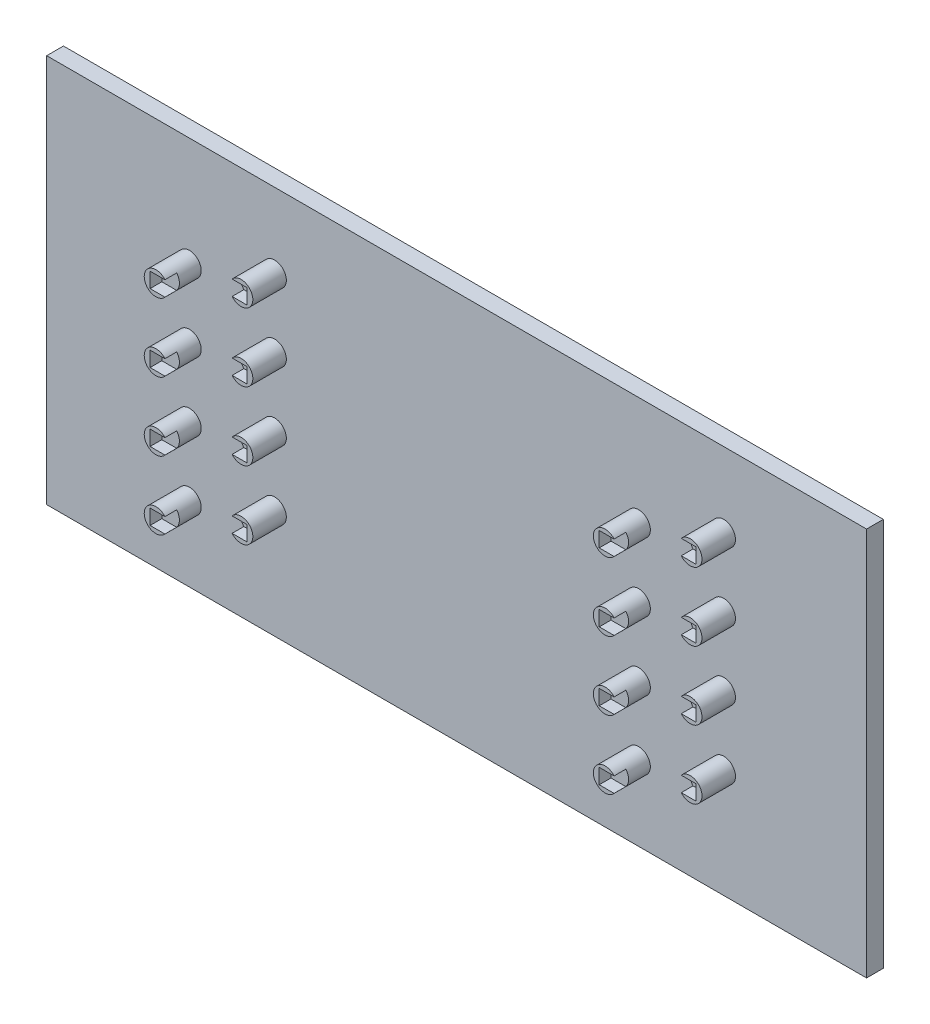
ISO-10303-21;
HEADER;
FILE_DESCRIPTION(('STEP AP214'),'2;1');
FILE_NAME('part.step','',(''),(''),'','','');
FILE_SCHEMA(('AUTOMOTIVE_DESIGN { 1 0 10303 214 1 1 1 1 }'));
ENDSEC;
DATA;
#1=APPLICATION_CONTEXT('core data for automotive mechanical design processes');
#2=APPLICATION_PROTOCOL_DEFINITION('international standard','automotive_design',2000,#1);
#3=PRODUCT_CONTEXT('',#1,'mechanical');
#4=PRODUCT('Part','Part','',(#3));
#5=PRODUCT_RELATED_PRODUCT_CATEGORY('part','',(#4));
#6=PRODUCT_DEFINITION_FORMATION('','',#4);
#7=PRODUCT_DEFINITION_CONTEXT('part definition',#1,'design');
#8=PRODUCT_DEFINITION('design','',#6,#7);
#9=PRODUCT_DEFINITION_SHAPE('','',#8);
#10=(LENGTH_UNIT() NAMED_UNIT(*) SI_UNIT(.MILLI.,.METRE.));
#11=(NAMED_UNIT(*) PLANE_ANGLE_UNIT() SI_UNIT($,.RADIAN.));
#12=(NAMED_UNIT(*) SI_UNIT($,.STERADIAN.) SOLID_ANGLE_UNIT());
#13=UNCERTAINTY_MEASURE_WITH_UNIT(LENGTH_MEASURE(1.E-05),#10,'distance_accuracy_value','');
#14=(GEOMETRIC_REPRESENTATION_CONTEXT(3) GLOBAL_UNCERTAINTY_ASSIGNED_CONTEXT((#13)) GLOBAL_UNIT_ASSIGNED_CONTEXT((#10,
#11,#12)) REPRESENTATION_CONTEXT('',''));
#15=CARTESIAN_POINT('',(0.,0.,0.));
#16=DIRECTION('',(0.,0.,1.));
#17=DIRECTION('',(1.,0.,0.));
#18=AXIS2_PLACEMENT_3D('',#15,#16,#17);
#19=CARTESIAN_POINT('',(-5.65986339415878,5.15473913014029,-6.14999999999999));
#20=DIRECTION('',(1.,0.,0.));
#21=DIRECTION('',(0.,0.,-1.));
#22=AXIS2_PLACEMENT_3D('',#19,#20,#21);
#23=PLANE('',#22);
#24=DIRECTION('',(0.,0.,1.));
#25=VECTOR('',#24,1.);
#26=CARTESIAN_POINT('',(-5.65986339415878,5.37973913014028,-1.55726875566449));
#27=LINE('',#26,#25);
#28=CARTESIAN_POINT('',(-5.65986339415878,5.37973913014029,-5.8));
#29=VERTEX_POINT('',#28);
#30=CARTESIAN_POINT('',(-5.65986339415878,5.37973913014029,-6.14999999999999));
#31=VERTEX_POINT('',#30);
#32=EDGE_CURVE('E460',#29,#31,#27,.F.);
#33=ORIENTED_EDGE('',*,*,#32,.T.);
#34=DIRECTION('',(0.,1.,0.));
#35=VECTOR('',#34,1.);
#36=CARTESIAN_POINT('',(-5.65986339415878,5.15473913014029,-6.14999999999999));
#37=LINE('',#36,#35);
#38=CARTESIAN_POINT('',(-5.65986339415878,4.92973913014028,-6.14999999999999));
#39=VERTEX_POINT('',#38);
#40=EDGE_CURVE('E456',#31,#39,#37,.F.);
#41=ORIENTED_EDGE('',*,*,#40,.T.);
#42=DIRECTION('',(0.,0.,-1.));
#43=VECTOR('',#42,1.);
#44=CARTESIAN_POINT('',(-5.65986339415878,4.92973913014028,-1.55726875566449));
#45=LINE('',#44,#43);
#46=CARTESIAN_POINT('',(-5.65986339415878,4.92973913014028,-5.79999999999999));
#47=VERTEX_POINT('',#46);
#48=EDGE_CURVE('E476',#39,#47,#45,.F.);
#49=ORIENTED_EDGE('',*,*,#48,.T.);
#50=DIRECTION('',(0.,1.,0.));
#51=VECTOR('',#50,1.);
#52=CARTESIAN_POINT('',(-5.65986339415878,7.88473913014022,-5.8));
#53=LINE('',#52,#51);
#54=EDGE_CURVE('E459',#47,#29,#53,.T.);
#55=ORIENTED_EDGE('',*,*,#54,.T.);
#56=EDGE_LOOP('',(#33,#41,#49,#55));
#57=FACE_BOUND('',#56,.T.);
#58=ADVANCED_FACE('F17',(#57),#23,.F.);
#59=CARTESIAN_POINT('',(-5.65986339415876,3.11473913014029,-6.14999999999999));
#60=DIRECTION('',(1.,0.,0.));
#61=DIRECTION('',(0.,0.,-1.));
#62=AXIS2_PLACEMENT_3D('',#59,#60,#61);
#63=PLANE('',#62);
#64=DIRECTION('',(0.,0.,1.));
#65=VECTOR('',#64,1.);
#66=CARTESIAN_POINT('',(-5.65986339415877,3.33973913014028,-1.55726875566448));
#67=LINE('',#66,#65);
#68=CARTESIAN_POINT('',(-5.65986339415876,3.33973913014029,-5.8));
#69=VERTEX_POINT('',#68);
#70=CARTESIAN_POINT('',(-5.65986339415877,3.33973913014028,-6.14999999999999));
#71=VERTEX_POINT('',#70);
#72=EDGE_CURVE('E822',#69,#71,#67,.F.);
#73=ORIENTED_EDGE('',*,*,#72,.T.);
#74=DIRECTION('',(0.,1.,0.));
#75=VECTOR('',#74,1.);
#76=CARTESIAN_POINT('',(-5.65986339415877,3.11473913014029,-6.14999999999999));
#77=LINE('',#76,#75);
#78=CARTESIAN_POINT('',(-5.65986339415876,2.88973913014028,-6.14999999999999));
#79=VERTEX_POINT('',#78);
#80=EDGE_CURVE('E475',#71,#79,#77,.F.);
#81=ORIENTED_EDGE('',*,*,#80,.T.);
#82=DIRECTION('',(0.,0.,-1.));
#83=VECTOR('',#82,1.);
#84=CARTESIAN_POINT('',(-5.65986339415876,2.88973913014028,-1.55726875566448));
#85=LINE('',#84,#83);
#86=CARTESIAN_POINT('',(-5.65986339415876,2.88973913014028,-5.79999999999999));
#87=VERTEX_POINT('',#86);
#88=EDGE_CURVE('E815',#79,#87,#85,.F.);
#89=ORIENTED_EDGE('',*,*,#88,.T.);
#90=DIRECTION('',(0.,1.,0.));
#91=VECTOR('',#90,1.);
#92=CARTESIAN_POINT('',(-5.65986339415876,7.88473913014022,-5.8));
#93=LINE('',#92,#91);
#94=EDGE_CURVE('E808',#87,#69,#93,.T.);
#95=ORIENTED_EDGE('',*,*,#94,.T.);
#96=EDGE_LOOP('',(#73,#81,#89,#95));
#97=FACE_BOUND('',#96,.T.);
#98=ADVANCED_FACE('F1696',(#97),#63,.F.);
#99=CARTESIAN_POINT('',(-5.65986339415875,1.07473913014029,-6.14999999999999));
#100=DIRECTION('',(1.,0.,0.));
#101=DIRECTION('',(0.,0.,-1.));
#102=AXIS2_PLACEMENT_3D('',#99,#100,#101);
#103=PLANE('',#102);
#104=DIRECTION('',(0.,0.,1.));
#105=VECTOR('',#104,1.);
#106=CARTESIAN_POINT('',(-5.65986339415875,1.29973913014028,-1.55726875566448));
#107=LINE('',#106,#105);
#108=CARTESIAN_POINT('',(-5.65986339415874,1.29973913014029,-5.8));
#109=VERTEX_POINT('',#108);
#110=CARTESIAN_POINT('',(-5.65986339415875,1.29973913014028,-6.14999999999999));
#111=VERTEX_POINT('',#110);
#112=EDGE_CURVE('E800',#109,#111,#107,.F.);
#113=ORIENTED_EDGE('',*,*,#112,.T.);
#114=DIRECTION('',(0.,1.,0.));
#115=VECTOR('',#114,1.);
#116=CARTESIAN_POINT('',(-5.65986339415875,1.07473913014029,-6.14999999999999));
#117=LINE('',#116,#115);
#118=CARTESIAN_POINT('',(-5.65986339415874,0.849739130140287,-6.14999999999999));
#119=VERTEX_POINT('',#118);
#120=EDGE_CURVE('E798',#111,#119,#117,.F.);
#121=ORIENTED_EDGE('',*,*,#120,.T.);
#122=DIRECTION('',(0.,0.,-1.));
#123=VECTOR('',#122,1.);
#124=CARTESIAN_POINT('',(-5.65986339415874,0.849739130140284,-1.55726875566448));
#125=LINE('',#124,#123);
#126=CARTESIAN_POINT('',(-5.65986339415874,0.849739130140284,-5.79999999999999));
#127=VERTEX_POINT('',#126);
#128=EDGE_CURVE('E792',#119,#127,#125,.F.);
#129=ORIENTED_EDGE('',*,*,#128,.T.);
#130=DIRECTION('',(0.,1.,0.));
#131=VECTOR('',#130,1.);
#132=CARTESIAN_POINT('',(-5.65986339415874,7.88473913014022,-5.8));
#133=LINE('',#132,#131);
#134=EDGE_CURVE('E785',#127,#109,#133,.T.);
#135=ORIENTED_EDGE('',*,*,#134,.T.);
#136=EDGE_LOOP('',(#113,#121,#129,#135));
#137=FACE_BOUND('',#136,.T.);
#138=ADVANCED_FACE('F1693',(#137),#103,.F.);
#139=CARTESIAN_POINT('',(-5.65986339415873,-0.96526086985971,-6.14999999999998));
#140=DIRECTION('',(1.,0.,0.));
#141=DIRECTION('',(0.,0.,-1.));
#142=AXIS2_PLACEMENT_3D('',#139,#140,#141);
#143=PLANE('',#142);
#144=DIRECTION('',(0.,0.,1.));
#145=VECTOR('',#144,1.);
#146=CARTESIAN_POINT('',(-5.65986339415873,-0.740260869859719,-1.55726875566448));
#147=LINE('',#146,#145);
#148=CARTESIAN_POINT('',(-5.65986339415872,-0.740260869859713,-5.8));
#149=VERTEX_POINT('',#148);
#150=CARTESIAN_POINT('',(-5.65986339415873,-0.740260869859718,-6.14999999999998));
#151=VERTEX_POINT('',#150);
#152=EDGE_CURVE('E777',#149,#151,#147,.F.);
#153=ORIENTED_EDGE('',*,*,#152,.T.);
#154=DIRECTION('',(0.,1.,0.));
#155=VECTOR('',#154,1.);
#156=CARTESIAN_POINT('',(-5.65986339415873,-0.965260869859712,-6.14999999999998));
#157=LINE('',#156,#155);
#158=CARTESIAN_POINT('',(-5.65986339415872,-1.19026086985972,-6.14999999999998));
#159=VERTEX_POINT('',#158);
#160=EDGE_CURVE('E775',#151,#159,#157,.F.);
#161=ORIENTED_EDGE('',*,*,#160,.T.);
#162=DIRECTION('',(0.,0.,-1.));
#163=VECTOR('',#162,1.);
#164=CARTESIAN_POINT('',(-5.65986339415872,-1.19026086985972,-1.55726875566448));
#165=LINE('',#164,#163);
#166=CARTESIAN_POINT('',(-5.65986339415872,-1.19026086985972,-5.79999999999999));
#167=VERTEX_POINT('',#166);
#168=EDGE_CURVE('E769',#159,#167,#165,.F.);
#169=ORIENTED_EDGE('',*,*,#168,.T.);
#170=DIRECTION('',(0.,1.,0.));
#171=VECTOR('',#170,1.);
#172=CARTESIAN_POINT('',(-5.65986339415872,7.88473913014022,-5.8));
#173=LINE('',#172,#171);
#174=EDGE_CURVE('E762',#167,#149,#173,.T.);
#175=ORIENTED_EDGE('',*,*,#174,.T.);
#176=EDGE_LOOP('',(#153,#161,#169,#175));
#177=FACE_BOUND('',#176,.T.);
#178=ADVANCED_FACE('F1689',(#177),#143,.F.);
#179=CARTESIAN_POINT('',(4.85013660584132,-1.98526086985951,-6.14999999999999));
#180=DIRECTION('',(-1.,0.,0.));
#181=DIRECTION('',(0.,0.,1.));
#182=AXIS2_PLACEMENT_3D('',#179,#180,#181);
#183=PLANE('',#182);
#184=DIRECTION('',(0.,0.,-1.));
#185=VECTOR('',#184,1.);
#186=CARTESIAN_POINT('',(4.85013660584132,-2.21026086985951,-1.55726875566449));
#187=LINE('',#186,#185);
#188=CARTESIAN_POINT('',(4.85013660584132,-2.21026086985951,-5.79999999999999));
#189=VERTEX_POINT('',#188);
#190=CARTESIAN_POINT('',(4.85013660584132,-2.21026086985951,-6.14999999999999));
#191=VERTEX_POINT('',#190);
#192=EDGE_CURVE('E746',#189,#191,#187,.T.);
#193=ORIENTED_EDGE('',*,*,#192,.T.);
#194=DIRECTION('',(0.,1.,0.));
#195=VECTOR('',#194,1.);
#196=CARTESIAN_POINT('',(4.85013660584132,-1.98526086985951,-6.14999999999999));
#197=LINE('',#196,#195);
#198=CARTESIAN_POINT('',(4.85013660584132,-1.76026086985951,-6.14999999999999));
#199=VERTEX_POINT('',#198);
#200=EDGE_CURVE('E739',#191,#199,#197,.T.);
#201=ORIENTED_EDGE('',*,*,#200,.T.);
#202=DIRECTION('',(0.,0.,1.));
#203=VECTOR('',#202,1.);
#204=CARTESIAN_POINT('',(4.85013660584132,-1.76026086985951,-1.55726875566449));
#205=LINE('',#204,#203);
#206=CARTESIAN_POINT('',(4.85013660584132,-1.76026086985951,-5.79999999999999));
#207=VERTEX_POINT('',#206);
#208=EDGE_CURVE('E754',#199,#207,#205,.T.);
#209=ORIENTED_EDGE('',*,*,#208,.T.);
#210=DIRECTION('',(0.,1.,0.));
#211=VECTOR('',#210,1.);
#212=CARTESIAN_POINT('',(4.85013660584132,-4.7152608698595,-5.79999999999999));
#213=LINE('',#212,#211);
#214=EDGE_CURVE('E752',#207,#189,#213,.F.);
#215=ORIENTED_EDGE('',*,*,#214,.T.);
#216=EDGE_LOOP('',(#193,#201,#209,#215));
#217=FACE_BOUND('',#216,.T.);
#218=ADVANCED_FACE('F1685',(#217),#183,.F.);
#219=CARTESIAN_POINT('',(4.85013660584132,0.054739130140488,-6.15));
#220=DIRECTION('',(-1.,0.,0.));
#221=DIRECTION('',(0.,0.,1.));
#222=AXIS2_PLACEMENT_3D('',#219,#220,#221);
#223=PLANE('',#222);
#224=DIRECTION('',(0.,0.,-1.));
#225=VECTOR('',#224,1.);
#226=CARTESIAN_POINT('',(4.85013660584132,-0.170260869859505,-1.55726875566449));
#227=LINE('',#226,#225);
#228=CARTESIAN_POINT('',(4.85013660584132,-0.170260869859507,-5.8));
#229=VERTEX_POINT('',#228);
#230=CARTESIAN_POINT('',(4.85013660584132,-0.170260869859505,-6.15));
#231=VERTEX_POINT('',#230);
#232=EDGE_CURVE('E723',#229,#231,#227,.T.);
#233=ORIENTED_EDGE('',*,*,#232,.T.);
#234=DIRECTION('',(0.,1.,0.));
#235=VECTOR('',#234,1.);
#236=CARTESIAN_POINT('',(4.85013660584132,0.054739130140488,-6.15));
#237=LINE('',#236,#235);
#238=CARTESIAN_POINT('',(4.85013660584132,0.279739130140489,-6.15));
#239=VERTEX_POINT('',#238);
#240=EDGE_CURVE('E716',#231,#239,#237,.T.);
#241=ORIENTED_EDGE('',*,*,#240,.T.);
#242=DIRECTION('',(0.,0.,1.));
#243=VECTOR('',#242,1.);
#244=CARTESIAN_POINT('',(4.85013660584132,0.279739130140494,-1.55726875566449));
#245=LINE('',#244,#243);
#246=CARTESIAN_POINT('',(4.85013660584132,0.279739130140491,-5.8));
#247=VERTEX_POINT('',#246);
#248=EDGE_CURVE('E731',#239,#247,#245,.T.);
#249=ORIENTED_EDGE('',*,*,#248,.T.);
#250=DIRECTION('',(0.,1.,0.));
#251=VECTOR('',#250,1.);
#252=CARTESIAN_POINT('',(4.85013660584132,-4.7152608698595,-5.79999999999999));
#253=LINE('',#252,#251);
#254=EDGE_CURVE('E729',#247,#229,#253,.F.);
#255=ORIENTED_EDGE('',*,*,#254,.T.);
#256=EDGE_LOOP('',(#233,#241,#249,#255));
#257=FACE_BOUND('',#256,.T.);
#258=ADVANCED_FACE('F1681',(#257),#223,.F.);
#259=CARTESIAN_POINT('',(4.85013660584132,2.09473913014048,-6.15));
#260=DIRECTION('',(-1.,0.,0.));
#261=DIRECTION('',(0.,0.,1.));
#262=AXIS2_PLACEMENT_3D('',#259,#260,#261);
#263=PLANE('',#262);
#264=DIRECTION('',(0.,0.,-1.));
#265=VECTOR('',#264,1.);
#266=CARTESIAN_POINT('',(4.85013660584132,1.86973913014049,-1.55726875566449));
#267=LINE('',#266,#265);
#268=CARTESIAN_POINT('',(4.85013660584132,1.86973913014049,-5.8));
#269=VERTEX_POINT('',#268);
#270=CARTESIAN_POINT('',(4.85013660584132,1.86973913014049,-6.15));
#271=VERTEX_POINT('',#270);
#272=EDGE_CURVE('E700',#269,#271,#267,.T.);
#273=ORIENTED_EDGE('',*,*,#272,.T.);
#274=DIRECTION('',(0.,1.,0.));
#275=VECTOR('',#274,1.);
#276=CARTESIAN_POINT('',(4.85013660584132,2.09473913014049,-6.15));
#277=LINE('',#276,#275);
#278=CARTESIAN_POINT('',(4.85013660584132,2.31973913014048,-6.15));
#279=VERTEX_POINT('',#278);
#280=EDGE_CURVE('E693',#271,#279,#277,.T.);
#281=ORIENTED_EDGE('',*,*,#280,.T.);
#282=DIRECTION('',(0.,0.,1.));
#283=VECTOR('',#282,1.);
#284=CARTESIAN_POINT('',(4.85013660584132,2.31973913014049,-1.55726875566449));
#285=LINE('',#284,#283);
#286=CARTESIAN_POINT('',(4.85013660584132,2.31973913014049,-5.8));
#287=VERTEX_POINT('',#286);
#288=EDGE_CURVE('E708',#279,#287,#285,.T.);
#289=ORIENTED_EDGE('',*,*,#288,.T.);
#290=DIRECTION('',(0.,1.,0.));
#291=VECTOR('',#290,1.);
#292=CARTESIAN_POINT('',(4.85013660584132,-4.7152608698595,-5.79999999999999));
#293=LINE('',#292,#291);
#294=EDGE_CURVE('E706',#287,#269,#293,.F.);
#295=ORIENTED_EDGE('',*,*,#294,.T.);
#296=EDGE_LOOP('',(#273,#281,#289,#295));
#297=FACE_BOUND('',#296,.T.);
#298=ADVANCED_FACE('F1677',(#297),#263,.F.);
#299=CARTESIAN_POINT('',(4.85013660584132,4.13473913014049,-6.15));
#300=DIRECTION('',(-1.,0.,0.));
#301=DIRECTION('',(0.,0.,1.));
#302=AXIS2_PLACEMENT_3D('',#299,#300,#301);
#303=PLANE('',#302);
#304=DIRECTION('',(0.,0.,-1.));
#305=VECTOR('',#304,1.);
#306=CARTESIAN_POINT('',(4.85013660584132,3.9097391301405,-1.5572687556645));
#307=LINE('',#306,#305);
#308=CARTESIAN_POINT('',(4.85013660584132,3.9097391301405,-5.8));
#309=VERTEX_POINT('',#308);
#310=CARTESIAN_POINT('',(4.85013660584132,3.9097391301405,-6.15));
#311=VERTEX_POINT('',#310);
#312=EDGE_CURVE('E677',#309,#311,#307,.T.);
#313=ORIENTED_EDGE('',*,*,#312,.T.);
#314=DIRECTION('',(0.,1.,0.));
#315=VECTOR('',#314,1.);
#316=CARTESIAN_POINT('',(4.85013660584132,4.13473913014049,-6.15));
#317=LINE('',#316,#315);
#318=CARTESIAN_POINT('',(4.85013660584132,4.35973913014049,-6.15));
#319=VERTEX_POINT('',#318);
#320=EDGE_CURVE('E670',#311,#319,#317,.T.);
#321=ORIENTED_EDGE('',*,*,#320,.T.);
#322=DIRECTION('',(0.,0.,1.));
#323=VECTOR('',#322,1.);
#324=CARTESIAN_POINT('',(4.85013660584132,4.35973913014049,-1.5572687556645));
#325=LINE('',#324,#323);
#326=CARTESIAN_POINT('',(4.85013660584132,4.35973913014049,-5.8));
#327=VERTEX_POINT('',#326);
#328=EDGE_CURVE('E685',#319,#327,#325,.T.);
#329=ORIENTED_EDGE('',*,*,#328,.T.);
#330=DIRECTION('',(0.,1.,0.));
#331=VECTOR('',#330,1.);
#332=CARTESIAN_POINT('',(4.85013660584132,-4.7152608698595,-5.79999999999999));
#333=LINE('',#332,#331);
#334=EDGE_CURVE('E683',#327,#309,#333,.F.);
#335=ORIENTED_EDGE('',*,*,#334,.T.);
#336=EDGE_LOOP('',(#313,#321,#329,#335));
#337=FACE_BOUND('',#336,.T.);
#338=ADVANCED_FACE('F1673',(#337),#303,.F.);
#339=CARTESIAN_POINT('',(7.74013660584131,5.1547391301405,-4.4));
#340=DIRECTION('',(1.,0.,0.));
#341=DIRECTION('',(0.,0.,-1.));
#342=AXIS2_PLACEMENT_3D('',#339,#340,#341);
#343=PLANE('',#342);
#344=DIRECTION('',(0.,0.,1.));
#345=VECTOR('',#344,1.);
#346=CARTESIAN_POINT('',(7.74013660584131,5.3797391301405,-2.62191993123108));
#347=LINE('',#346,#345);
#348=CARTESIAN_POINT('',(7.74013660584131,5.3797391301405,-5.79999999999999));
#349=VERTEX_POINT('',#348);
#350=CARTESIAN_POINT('',(7.74013660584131,5.3797391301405,-6.15000000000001));
#351=VERTEX_POINT('',#350);
#352=EDGE_CURVE('E662',#349,#351,#347,.F.);
#353=ORIENTED_EDGE('',*,*,#352,.T.);
#354=DIRECTION('',(0.,1.,0.));
#355=VECTOR('',#354,1.);
#356=CARTESIAN_POINT('',(7.74013660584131,5.15473913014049,-6.15000000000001));
#357=LINE('',#356,#355);
#358=CARTESIAN_POINT('',(7.74013660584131,4.9297391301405,-6.15000000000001));
#359=VERTEX_POINT('',#358);
#360=EDGE_CURVE('E660',#351,#359,#357,.F.);
#361=ORIENTED_EDGE('',*,*,#360,.T.);
#362=DIRECTION('',(0.,0.,-1.));
#363=VECTOR('',#362,1.);
#364=CARTESIAN_POINT('',(7.74013660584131,4.9297391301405,-2.62191993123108));
#365=LINE('',#364,#363);
#366=CARTESIAN_POINT('',(7.74013660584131,4.9297391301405,-5.8));
#367=VERTEX_POINT('',#366);
#368=EDGE_CURVE('E654',#359,#367,#365,.F.);
#369=ORIENTED_EDGE('',*,*,#368,.T.);
#370=DIRECTION('',(0.,1.,0.));
#371=VECTOR('',#370,1.);
#372=CARTESIAN_POINT('',(7.74013660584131,-4.7152608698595,-5.79999999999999));
#373=LINE('',#372,#371);
#374=EDGE_CURVE('E647',#367,#349,#373,.T.);
#375=ORIENTED_EDGE('',*,*,#374,.T.);
#376=EDGE_LOOP('',(#353,#361,#369,#375));
#377=FACE_BOUND('',#376,.T.);
#378=ADVANCED_FACE('F1669',(#377),#343,.F.);
#379=CARTESIAN_POINT('',(7.74013660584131,3.11473913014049,-4.4));
#380=DIRECTION('',(1.,0.,0.));
#381=DIRECTION('',(0.,0.,-1.));
#382=AXIS2_PLACEMENT_3D('',#379,#380,#381);
#383=PLANE('',#382);
#384=DIRECTION('',(0.,0.,1.));
#385=VECTOR('',#384,1.);
#386=CARTESIAN_POINT('',(7.74013660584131,3.3397391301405,-2.62191993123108));
#387=LINE('',#386,#385);
#388=CARTESIAN_POINT('',(7.74013660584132,3.33973913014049,-5.79999999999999));
#389=VERTEX_POINT('',#388);
#390=CARTESIAN_POINT('',(7.74013660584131,3.3397391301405,-6.15));
#391=VERTEX_POINT('',#390);
#392=EDGE_CURVE('E639',#389,#391,#387,.F.);
#393=ORIENTED_EDGE('',*,*,#392,.T.);
#394=DIRECTION('',(0.,1.,0.));
#395=VECTOR('',#394,1.);
#396=CARTESIAN_POINT('',(7.74013660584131,3.11473913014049,-6.15));
#397=LINE('',#396,#395);
#398=CARTESIAN_POINT('',(7.74013660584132,2.8897391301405,-6.15));
#399=VERTEX_POINT('',#398);
#400=EDGE_CURVE('E637',#391,#399,#397,.F.);
#401=ORIENTED_EDGE('',*,*,#400,.T.);
#402=DIRECTION('',(0.,0.,-1.));
#403=VECTOR('',#402,1.);
#404=CARTESIAN_POINT('',(7.74013660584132,2.8897391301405,-2.62191993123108));
#405=LINE('',#404,#403);
#406=CARTESIAN_POINT('',(7.74013660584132,2.8897391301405,-5.8));
#407=VERTEX_POINT('',#406);
#408=EDGE_CURVE('E631',#399,#407,#405,.F.);
#409=ORIENTED_EDGE('',*,*,#408,.T.);
#410=DIRECTION('',(0.,1.,0.));
#411=VECTOR('',#410,1.);
#412=CARTESIAN_POINT('',(7.74013660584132,-4.7152608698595,-5.79999999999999));
#413=LINE('',#412,#411);
#414=EDGE_CURVE('E624',#407,#389,#413,.T.);
#415=ORIENTED_EDGE('',*,*,#414,.T.);
#416=EDGE_LOOP('',(#393,#401,#409,#415));
#417=FACE_BOUND('',#416,.T.);
#418=ADVANCED_FACE('F1665',(#417),#383,.F.);
#419=CARTESIAN_POINT('',(7.74013660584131,1.0747391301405,-4.4));
#420=DIRECTION('',(1.,0.,0.));
#421=DIRECTION('',(0.,0.,-1.));
#422=AXIS2_PLACEMENT_3D('',#419,#420,#421);
#423=PLANE('',#422);
#424=DIRECTION('',(0.,0.,1.));
#425=VECTOR('',#424,1.);
#426=CARTESIAN_POINT('',(7.74013660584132,1.2997391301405,-2.62191993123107));
#427=LINE('',#426,#425);
#428=CARTESIAN_POINT('',(7.74013660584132,1.29973913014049,-5.79999999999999));
#429=VERTEX_POINT('',#428);
#430=CARTESIAN_POINT('',(7.74013660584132,1.2997391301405,-6.15));
#431=VERTEX_POINT('',#430);
#432=EDGE_CURVE('E616',#429,#431,#427,.F.);
#433=ORIENTED_EDGE('',*,*,#432,.T.);
#434=DIRECTION('',(0.,1.,0.));
#435=VECTOR('',#434,1.);
#436=CARTESIAN_POINT('',(7.74013660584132,1.0747391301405,-6.15));
#437=LINE('',#436,#435);
#438=CARTESIAN_POINT('',(7.74013660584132,0.849739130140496,-6.15));
#439=VERTEX_POINT('',#438);
#440=EDGE_CURVE('E614',#431,#439,#437,.F.);
#441=ORIENTED_EDGE('',*,*,#440,.T.);
#442=DIRECTION('',(0.,0.,-1.));
#443=VECTOR('',#442,1.);
#444=CARTESIAN_POINT('',(7.74013660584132,0.849739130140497,-2.62191993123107));
#445=LINE('',#444,#443);
#446=CARTESIAN_POINT('',(7.74013660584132,0.849739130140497,-5.8));
#447=VERTEX_POINT('',#446);
#448=EDGE_CURVE('E608',#439,#447,#445,.F.);
#449=ORIENTED_EDGE('',*,*,#448,.T.);
#450=DIRECTION('',(0.,1.,0.));
#451=VECTOR('',#450,1.);
#452=CARTESIAN_POINT('',(7.74013660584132,-4.7152608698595,-5.79999999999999));
#453=LINE('',#452,#451);
#454=EDGE_CURVE('E601',#447,#429,#453,.T.);
#455=ORIENTED_EDGE('',*,*,#454,.T.);
#456=EDGE_LOOP('',(#433,#441,#449,#455));
#457=FACE_BOUND('',#456,.T.);
#458=ADVANCED_FACE('F1661',(#457),#423,.F.);
#459=CARTESIAN_POINT('',(7.74013660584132,-0.965260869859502,-4.39999999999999));
#460=DIRECTION('',(1.,0.,0.));
#461=DIRECTION('',(0.,0.,-1.));
#462=AXIS2_PLACEMENT_3D('',#459,#460,#461);
#463=PLANE('',#462);
#464=DIRECTION('',(0.,0.,1.));
#465=VECTOR('',#464,1.);
#466=CARTESIAN_POINT('',(7.74013660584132,-0.740260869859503,-2.62191993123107));
#467=LINE('',#466,#465);
#468=CARTESIAN_POINT('',(7.74013660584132,-0.740260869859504,-5.79999999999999));
#469=VERTEX_POINT('',#468);
#470=CARTESIAN_POINT('',(7.74013660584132,-0.740260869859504,-6.14999999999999));
#471=VERTEX_POINT('',#470);
#472=EDGE_CURVE('E593',#469,#471,#467,.F.);
#473=ORIENTED_EDGE('',*,*,#472,.T.);
#474=DIRECTION('',(0.,1.,0.));
#475=VECTOR('',#474,1.);
#476=CARTESIAN_POINT('',(7.74013660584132,-0.965260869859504,-6.14999999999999));
#477=LINE('',#476,#475);
#478=CARTESIAN_POINT('',(7.74013660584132,-1.1902608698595,-6.14999999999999));
#479=VERTEX_POINT('',#478);
#480=EDGE_CURVE('E591',#471,#479,#477,.F.);
#481=ORIENTED_EDGE('',*,*,#480,.T.);
#482=DIRECTION('',(0.,0.,-1.));
#483=VECTOR('',#482,1.);
#484=CARTESIAN_POINT('',(7.74013660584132,-1.1902608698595,-2.62191993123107));
#485=LINE('',#484,#483);
#486=CARTESIAN_POINT('',(7.74013660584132,-1.1902608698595,-5.8));
#487=VERTEX_POINT('',#486);
#488=EDGE_CURVE('E585',#479,#487,#485,.F.);
#489=ORIENTED_EDGE('',*,*,#488,.T.);
#490=DIRECTION('',(0.,1.,0.));
#491=VECTOR('',#490,1.);
#492=CARTESIAN_POINT('',(7.74013660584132,-4.7152608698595,-5.79999999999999));
#493=LINE('',#492,#491);
#494=EDGE_CURVE('E578',#487,#469,#493,.T.);
#495=ORIENTED_EDGE('',*,*,#494,.T.);
#496=EDGE_LOOP('',(#473,#481,#489,#495));
#497=FACE_BOUND('',#496,.T.);
#498=ADVANCED_FACE('F1657',(#497),#463,.F.);
#499=CARTESIAN_POINT('',(-8.54986339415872,-1.98526086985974,-4.39999999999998));
#500=DIRECTION('',(-1.,0.,0.));
#501=DIRECTION('',(0.,0.,1.));
#502=AXIS2_PLACEMENT_3D('',#499,#500,#501);
#503=PLANE('',#502);
#504=DIRECTION('',(0.,0.,-1.));
#505=VECTOR('',#504,1.);
#506=CARTESIAN_POINT('',(-8.54986339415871,-2.21026086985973,-2.62191993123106));
#507=LINE('',#506,#505);
#508=CARTESIAN_POINT('',(-8.54986339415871,-2.21026086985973,-5.79999999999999));
#509=VERTEX_POINT('',#508);
#510=CARTESIAN_POINT('',(-8.54986339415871,-2.21026086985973,-6.14999999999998));
#511=VERTEX_POINT('',#510);
#512=EDGE_CURVE('E562',#509,#511,#507,.T.);
#513=ORIENTED_EDGE('',*,*,#512,.T.);
#514=DIRECTION('',(0.,1.,0.));
#515=VECTOR('',#514,1.);
#516=CARTESIAN_POINT('',(-8.54986339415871,-1.98526086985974,-6.14999999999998));
#517=LINE('',#516,#515);
#518=CARTESIAN_POINT('',(-8.54986339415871,-1.76026086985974,-6.14999999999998));
#519=VERTEX_POINT('',#518);
#520=EDGE_CURVE('E555',#511,#519,#517,.T.);
#521=ORIENTED_EDGE('',*,*,#520,.T.);
#522=DIRECTION('',(0.,0.,1.));
#523=VECTOR('',#522,1.);
#524=CARTESIAN_POINT('',(-8.54986339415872,-1.76026086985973,-2.62191993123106));
#525=LINE('',#524,#523);
#526=CARTESIAN_POINT('',(-8.54986339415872,-1.76026086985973,-5.79999999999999));
#527=VERTEX_POINT('',#526);
#528=EDGE_CURVE('E570',#519,#527,#525,.T.);
#529=ORIENTED_EDGE('',*,*,#528,.T.);
#530=DIRECTION('',(0.,1.,0.));
#531=VECTOR('',#530,1.);
#532=CARTESIAN_POINT('',(-8.54986339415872,7.88473913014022,-5.8));
#533=LINE('',#532,#531);
#534=EDGE_CURVE('E568',#527,#509,#533,.F.);
#535=ORIENTED_EDGE('',*,*,#534,.T.);
#536=EDGE_LOOP('',(#513,#521,#529,#535));
#537=FACE_BOUND('',#536,.T.);
#538=ADVANCED_FACE('F1653',(#537),#503,.F.);
#539=CARTESIAN_POINT('',(-8.54986339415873,0.054739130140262,-4.39999999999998));
#540=DIRECTION('',(-1.,0.,0.));
#541=DIRECTION('',(0.,0.,1.));
#542=AXIS2_PLACEMENT_3D('',#539,#540,#541);
#543=PLANE('',#542);
#544=DIRECTION('',(0.,0.,-1.));
#545=VECTOR('',#544,1.);
#546=CARTESIAN_POINT('',(-8.54986339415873,-0.170260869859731,-2.62191993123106));
#547=LINE('',#546,#545);
#548=CARTESIAN_POINT('',(-8.54986339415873,-0.170260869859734,-5.79999999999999));
#549=VERTEX_POINT('',#548);
#550=CARTESIAN_POINT('',(-8.54986339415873,-0.170260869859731,-6.14999999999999));
#551=VERTEX_POINT('',#550);
#552=EDGE_CURVE('E539',#549,#551,#547,.T.);
#553=ORIENTED_EDGE('',*,*,#552,.T.);
#554=DIRECTION('',(0.,1.,0.));
#555=VECTOR('',#554,1.);
#556=CARTESIAN_POINT('',(-8.54986339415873,0.05473913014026,-6.14999999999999));
#557=LINE('',#556,#555);
#558=CARTESIAN_POINT('',(-8.54986339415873,0.279739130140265,-6.14999999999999));
#559=VERTEX_POINT('',#558);
#560=EDGE_CURVE('E532',#551,#559,#557,.T.);
#561=ORIENTED_EDGE('',*,*,#560,.T.);
#562=DIRECTION('',(0.,0.,1.));
#563=VECTOR('',#562,1.);
#564=CARTESIAN_POINT('',(-8.54986339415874,0.279739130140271,-2.62191993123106));
#565=LINE('',#564,#563);
#566=CARTESIAN_POINT('',(-8.54986339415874,0.279739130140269,-5.79999999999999));
#567=VERTEX_POINT('',#566);
#568=EDGE_CURVE('E547',#559,#567,#565,.T.);
#569=ORIENTED_EDGE('',*,*,#568,.T.);
#570=DIRECTION('',(0.,1.,0.));
#571=VECTOR('',#570,1.);
#572=CARTESIAN_POINT('',(-8.54986339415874,7.88473913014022,-5.8));
#573=LINE('',#572,#571);
#574=EDGE_CURVE('E545',#567,#549,#573,.F.);
#575=ORIENTED_EDGE('',*,*,#574,.T.);
#576=EDGE_LOOP('',(#553,#561,#569,#575));
#577=FACE_BOUND('',#576,.T.);
#578=ADVANCED_FACE('F1649',(#577),#543,.F.);
#579=CARTESIAN_POINT('',(-8.54986339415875,2.09473913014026,-4.39999999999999));
#580=DIRECTION('',(-1.,0.,0.));
#581=DIRECTION('',(0.,0.,1.));
#582=AXIS2_PLACEMENT_3D('',#579,#580,#581);
#583=PLANE('',#582);
#584=DIRECTION('',(0.,0.,-1.));
#585=VECTOR('',#584,1.);
#586=CARTESIAN_POINT('',(-8.54986339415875,1.86973913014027,-2.62191993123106));
#587=LINE('',#586,#585);
#588=CARTESIAN_POINT('',(-8.54986339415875,1.86973913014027,-5.79999999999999));
#589=VERTEX_POINT('',#588);
#590=CARTESIAN_POINT('',(-8.54986339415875,1.86973913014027,-6.14999999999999));
#591=VERTEX_POINT('',#590);
#592=EDGE_CURVE('E516',#589,#591,#587,.T.);
#593=ORIENTED_EDGE('',*,*,#592,.T.);
#594=DIRECTION('',(0.,1.,0.));
#595=VECTOR('',#594,1.);
#596=CARTESIAN_POINT('',(-8.54986339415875,2.09473913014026,-6.14999999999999));
#597=LINE('',#596,#595);
#598=CARTESIAN_POINT('',(-8.54986339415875,2.31973913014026,-6.14999999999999));
#599=VERTEX_POINT('',#598);
#600=EDGE_CURVE('E509',#591,#599,#597,.T.);
#601=ORIENTED_EDGE('',*,*,#600,.T.);
#602=DIRECTION('',(0.,0.,1.));
#603=VECTOR('',#602,1.);
#604=CARTESIAN_POINT('',(-8.54986339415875,2.31973913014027,-2.62191993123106));
#605=LINE('',#604,#603);
#606=CARTESIAN_POINT('',(-8.54986339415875,2.31973913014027,-5.79999999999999));
#607=VERTEX_POINT('',#606);
#608=EDGE_CURVE('E524',#599,#607,#605,.T.);
#609=ORIENTED_EDGE('',*,*,#608,.T.);
#610=DIRECTION('',(0.,1.,0.));
#611=VECTOR('',#610,1.);
#612=CARTESIAN_POINT('',(-8.54986339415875,7.88473913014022,-5.8));
#613=LINE('',#612,#611);
#614=EDGE_CURVE('E522',#607,#589,#613,.F.);
#615=ORIENTED_EDGE('',*,*,#614,.T.);
#616=EDGE_LOOP('',(#593,#601,#609,#615));
#617=FACE_BOUND('',#616,.T.);
#618=ADVANCED_FACE('F1645',(#617),#583,.F.);
#619=CARTESIAN_POINT('',(-8.54986339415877,4.13473913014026,-4.39999999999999));
#620=DIRECTION('',(-1.,0.,0.));
#621=DIRECTION('',(0.,0.,1.));
#622=AXIS2_PLACEMENT_3D('',#619,#620,#621);
#623=PLANE('',#622);
#624=DIRECTION('',(0.,0.,-1.));
#625=VECTOR('',#624,1.);
#626=CARTESIAN_POINT('',(-8.54986339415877,3.90973913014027,-2.62191993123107));
#627=LINE('',#626,#625);
#628=CARTESIAN_POINT('',(-8.54986339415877,3.90973913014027,-5.79999999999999));
#629=VERTEX_POINT('',#628);
#630=CARTESIAN_POINT('',(-8.54986339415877,3.90973913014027,-6.14999999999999));
#631=VERTEX_POINT('',#630);
#632=EDGE_CURVE('E493',#629,#631,#627,.T.);
#633=ORIENTED_EDGE('',*,*,#632,.T.);
#634=DIRECTION('',(0.,1.,0.));
#635=VECTOR('',#634,1.);
#636=CARTESIAN_POINT('',(-8.54986339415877,4.13473913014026,-6.14999999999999));
#637=LINE('',#636,#635);
#638=CARTESIAN_POINT('',(-8.54986339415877,4.35973913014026,-6.14999999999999));
#639=VERTEX_POINT('',#638);
#640=EDGE_CURVE('E486',#631,#639,#637,.T.);
#641=ORIENTED_EDGE('',*,*,#640,.T.);
#642=DIRECTION('',(0.,0.,1.));
#643=VECTOR('',#642,1.);
#644=CARTESIAN_POINT('',(-8.54986339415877,4.35973913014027,-2.62191993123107));
#645=LINE('',#644,#643);
#646=CARTESIAN_POINT('',(-8.54986339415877,4.35973913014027,-5.79999999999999));
#647=VERTEX_POINT('',#646);
#648=EDGE_CURVE('E501',#639,#647,#645,.T.);
#649=ORIENTED_EDGE('',*,*,#648,.T.);
#650=DIRECTION('',(0.,1.,0.));
#651=VECTOR('',#650,1.);
#652=CARTESIAN_POINT('',(-8.54986339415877,7.88473913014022,-5.8));
#653=LINE('',#652,#651);
#654=EDGE_CURVE('E499',#647,#629,#653,.F.);
#655=ORIENTED_EDGE('',*,*,#654,.T.);
#656=EDGE_LOOP('',(#633,#641,#649,#655));
#657=FACE_BOUND('',#656,.T.);
#658=ADVANCED_FACE('F1642',(#657),#623,.F.);
#659=CARTESIAN_POINT('',(-6.00986339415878,5.15473913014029,-6.14999999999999));
#660=DIRECTION('',(0.,0.,-1.));
#661=DIRECTION('',(-1.,0.,0.));
#662=AXIS2_PLACEMENT_3D('',#659,#660,#661);
#663=PLANE('',#662);
#664=DIRECTION('',(1.,0.,0.));
#665=VECTOR('',#664,1.);
#666=CARTESIAN_POINT('',(-7.67338393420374,4.92973913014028,-6.14999999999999));
#667=LINE('',#666,#665);
#668=CARTESIAN_POINT('',(-6.10295852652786,4.92973913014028,-6.14999999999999));
#669=VERTEX_POINT('',#668);
#670=EDGE_CURVE('E440',#669,#39,#667,.T.);
#671=ORIENTED_EDGE('',*,*,#670,.T.);
#672=ORIENTED_EDGE('',*,*,#40,.F.);
#673=DIRECTION('',(1.,0.,0.));
#674=VECTOR('',#673,1.);
#675=CARTESIAN_POINT('',(-7.67338393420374,5.37973913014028,-6.14999999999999));
#676=LINE('',#675,#674);
#677=CARTESIAN_POINT('',(-6.10295852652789,5.37973913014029,-6.14999999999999));
#678=VERTEX_POINT('',#677);
#679=EDGE_CURVE('E454',#31,#678,#676,.F.);
#680=ORIENTED_EDGE('',*,*,#679,.T.);
#681=CARTESIAN_POINT('',(-5.83486339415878,5.1547391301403,-6.14999999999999));
#682=DIRECTION('',(0.,0.,1.));
#683=DIRECTION('',(1.,0.,0.));
#684=AXIS2_PLACEMENT_3D('',#681,#682,#683);
#685=CIRCLE('',#684,0.35);
#686=EDGE_CURVE('E20',#669,#678,#685,.F.);
#687=ORIENTED_EDGE('',*,*,#686,.F.);
#688=EDGE_LOOP('',(#671,#672,#680,#687));
#689=FACE_BOUND('',#688,.T.);
#690=ADVANCED_FACE('F455',(#689),#663,.F.);
#691=CARTESIAN_POINT('',(-7.67338393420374,5.37973913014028,-1.55726875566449));
#692=DIRECTION('',(0.,1.,0.));
#693=DIRECTION('',(0.,0.,1.));
#694=AXIS2_PLACEMENT_3D('',#691,#692,#693);
#695=PLANE('',#694);
#696=ORIENTED_EDGE('',*,*,#679,.F.);
#697=ORIENTED_EDGE('',*,*,#32,.F.);
#698=DIRECTION('',(-1.,0.,0.));
#699=VECTOR('',#698,1.);
#700=CARTESIAN_POINT('',(-12.6348633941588,5.37973913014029,-5.8));
#701=LINE('',#700,#699);
#702=CARTESIAN_POINT('',(-6.10295852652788,5.37973913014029,-5.8));
#703=VERTEX_POINT('',#702);
#704=EDGE_CURVE('E464',#29,#703,#701,.T.);
#705=ORIENTED_EDGE('',*,*,#704,.T.);
#706=DIRECTION('',(0.,0.,1.));
#707=VECTOR('',#706,1.);
#708=CARTESIAN_POINT('',(-6.10295852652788,5.37973913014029,-6.29999999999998));
#709=LINE('',#708,#707);
#710=EDGE_CURVE('E448',#678,#703,#709,.T.);
#711=ORIENTED_EDGE('',*,*,#710,.F.);
#712=EDGE_LOOP('',(#696,#697,#705,#711));
#713=FACE_BOUND('',#712,.T.);
#714=ADVANCED_FACE('F462',(#713),#695,.F.);
#715=CARTESIAN_POINT('',(-12.6348633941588,7.88473913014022,-5.8));
#716=DIRECTION('',(0.,0.,-1.));
#717=DIRECTION('',(-1.,0.,0.));
#718=AXIS2_PLACEMENT_3D('',#715,#716,#717);
#719=PLANE('',#718);
#720=ORIENTED_EDGE('',*,*,#704,.F.);
#721=ORIENTED_EDGE('',*,*,#54,.F.);
#722=DIRECTION('',(1.,0.,0.));
#723=VECTOR('',#722,1.);
#724=CARTESIAN_POINT('',(-7.67338393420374,4.92973913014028,-5.79999999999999));
#725=LINE('',#724,#723);
#726=CARTESIAN_POINT('',(-6.10295852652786,4.92973913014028,-5.79999999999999));
#727=VERTEX_POINT('',#726);
#728=EDGE_CURVE('E472',#47,#727,#725,.F.);
#729=ORIENTED_EDGE('',*,*,#728,.T.);
#730=CARTESIAN_POINT('',(-5.83486339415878,5.1547391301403,-5.79999999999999));
#731=DIRECTION('',(0.,0.,1.));
#732=DIRECTION('',(1.,0.,0.));
#733=AXIS2_PLACEMENT_3D('',#730,#731,#732);
#734=CIRCLE('',#733,0.35);
#735=EDGE_CURVE('E466',#703,#727,#734,.F.);
#736=ORIENTED_EDGE('',*,*,#735,.F.);
#737=EDGE_LOOP('',(#720,#721,#729,#736));
#738=FACE_BOUND('',#737,.T.);
#739=ADVANCED_FACE('F1634',(#738),#719,.F.);
#740=CARTESIAN_POINT('',(-7.67338393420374,4.92973913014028,-1.55726875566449));
#741=DIRECTION('',(0.,-1.,0.));
#742=DIRECTION('',(0.,0.,-1.));
#743=AXIS2_PLACEMENT_3D('',#740,#741,#742);
#744=PLANE('',#743);
#745=ORIENTED_EDGE('',*,*,#728,.F.);
#746=ORIENTED_EDGE('',*,*,#48,.F.);
#747=ORIENTED_EDGE('',*,*,#670,.F.);
#748=DIRECTION('',(0.,0.,1.));
#749=VECTOR('',#748,1.);
#750=CARTESIAN_POINT('',(-6.10295852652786,4.92973913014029,-6.29999999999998));
#751=LINE('',#750,#749);
#752=EDGE_CURVE('E450',#727,#669,#751,.F.);
#753=ORIENTED_EDGE('',*,*,#752,.F.);
#754=EDGE_LOOP('',(#745,#746,#747,#753));
#755=FACE_BOUND('',#754,.T.);
#756=ADVANCED_FACE('F1631',(#755),#744,.F.);
#757=CARTESIAN_POINT('',(-6.00986339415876,3.11473913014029,-6.14999999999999));
#758=DIRECTION('',(0.,0.,-1.));
#759=DIRECTION('',(-1.,0.,0.));
#760=AXIS2_PLACEMENT_3D('',#757,#758,#759);
#761=PLANE('',#760);
#762=DIRECTION('',(1.,0.,0.));
#763=VECTOR('',#762,1.);
#764=CARTESIAN_POINT('',(-7.67338393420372,2.88973913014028,-6.14999999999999));
#765=LINE('',#764,#763);
#766=CARTESIAN_POINT('',(-6.10295852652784,2.88973913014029,-6.14999999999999));
#767=VERTEX_POINT('',#766);
#768=EDGE_CURVE('E818',#767,#79,#765,.T.);
#769=ORIENTED_EDGE('',*,*,#768,.T.);
#770=ORIENTED_EDGE('',*,*,#80,.F.);
#771=DIRECTION('',(1.,0.,0.));
#772=VECTOR('',#771,1.);
#773=CARTESIAN_POINT('',(-7.67338393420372,3.33973913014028,-6.14999999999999));
#774=LINE('',#773,#772);
#775=CARTESIAN_POINT('',(-6.10295852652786,3.33973913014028,-6.14999999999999));
#776=VERTEX_POINT('',#775);
#777=EDGE_CURVE('E812',#71,#776,#774,.F.);
#778=ORIENTED_EDGE('',*,*,#777,.T.);
#779=CARTESIAN_POINT('',(-5.83486339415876,3.1147391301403,-6.14999999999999));
#780=DIRECTION('',(0.,0.,1.));
#781=DIRECTION('',(1.,0.,0.));
#782=AXIS2_PLACEMENT_3D('',#779,#780,#781);
#783=CIRCLE('',#782,0.349999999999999);
#784=EDGE_CURVE('E479',#767,#776,#783,.F.);
#785=ORIENTED_EDGE('',*,*,#784,.F.);
#786=EDGE_LOOP('',(#769,#770,#778,#785));
#787=FACE_BOUND('',#786,.T.);
#788=ADVANCED_FACE('F1628',(#787),#761,.F.);
#789=CARTESIAN_POINT('',(-7.67338393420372,3.33973913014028,-1.55726875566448));
#790=DIRECTION('',(0.,1.,0.));
#791=DIRECTION('',(0.,0.,1.));
#792=AXIS2_PLACEMENT_3D('',#789,#790,#791);
#793=PLANE('',#792);
#794=ORIENTED_EDGE('',*,*,#777,.F.);
#795=ORIENTED_EDGE('',*,*,#72,.F.);
#796=DIRECTION('',(-1.,0.,0.));
#797=VECTOR('',#796,1.);
#798=CARTESIAN_POINT('',(-12.6348633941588,3.33973913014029,-5.8));
#799=LINE('',#798,#797);
#800=CARTESIAN_POINT('',(-6.10295852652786,3.33973913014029,-5.8));
#801=VERTEX_POINT('',#800);
#802=EDGE_CURVE('E811',#69,#801,#799,.T.);
#803=ORIENTED_EDGE('',*,*,#802,.T.);
#804=DIRECTION('',(0.,0.,1.));
#805=VECTOR('',#804,1.);
#806=CARTESIAN_POINT('',(-6.10295852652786,3.33973913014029,-6.29999999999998));
#807=LINE('',#806,#805);
#808=EDGE_CURVE('E979',#776,#801,#807,.T.);
#809=ORIENTED_EDGE('',*,*,#808,.F.);
#810=EDGE_LOOP('',(#794,#795,#803,#809));
#811=FACE_BOUND('',#810,.T.);
#812=ADVANCED_FACE('F1624',(#811),#793,.F.);
#813=CARTESIAN_POINT('',(-12.6348633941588,7.88473913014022,-5.8));
#814=DIRECTION('',(0.,0.,-1.));
#815=DIRECTION('',(-1.,0.,0.));
#816=AXIS2_PLACEMENT_3D('',#813,#814,#815);
#817=PLANE('',#816);
#818=ORIENTED_EDGE('',*,*,#802,.F.);
#819=ORIENTED_EDGE('',*,*,#94,.F.);
#820=DIRECTION('',(1.,0.,0.));
#821=VECTOR('',#820,1.);
#822=CARTESIAN_POINT('',(-7.67338393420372,2.88973913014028,-5.79999999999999));
#823=LINE('',#822,#821);
#824=CARTESIAN_POINT('',(-6.10295852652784,2.88973913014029,-5.79999999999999));
#825=VERTEX_POINT('',#824);
#826=EDGE_CURVE('E801',#87,#825,#823,.F.);
#827=ORIENTED_EDGE('',*,*,#826,.T.);
#828=CARTESIAN_POINT('',(-5.83486339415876,3.1147391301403,-5.79999999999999));
#829=DIRECTION('',(0.,0.,1.));
#830=DIRECTION('',(1.,0.,0.));
#831=AXIS2_PLACEMENT_3D('',#828,#829,#830);
#832=CIRCLE('',#831,0.349999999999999);
#833=EDGE_CURVE('E977',#801,#825,#832,.F.);
#834=ORIENTED_EDGE('',*,*,#833,.F.);
#835=EDGE_LOOP('',(#818,#819,#827,#834));
#836=FACE_BOUND('',#835,.T.);
#837=ADVANCED_FACE('F1620',(#836),#817,.F.);
#838=CARTESIAN_POINT('',(-7.67338393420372,2.88973913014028,-1.55726875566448));
#839=DIRECTION('',(0.,-1.,0.));
#840=DIRECTION('',(0.,0.,-1.));
#841=AXIS2_PLACEMENT_3D('',#838,#839,#840);
#842=PLANE('',#841);
#843=ORIENTED_EDGE('',*,*,#826,.F.);
#844=ORIENTED_EDGE('',*,*,#88,.F.);
#845=ORIENTED_EDGE('',*,*,#768,.F.);
#846=DIRECTION('',(0.,0.,1.));
#847=VECTOR('',#846,1.);
#848=CARTESIAN_POINT('',(-6.10295852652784,2.88973913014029,-6.29999999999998));
#849=LINE('',#848,#847);
#850=EDGE_CURVE('E976',#825,#767,#849,.F.);
#851=ORIENTED_EDGE('',*,*,#850,.F.);
#852=EDGE_LOOP('',(#843,#844,#845,#851));
#853=FACE_BOUND('',#852,.T.);
#854=ADVANCED_FACE('F1616',(#853),#842,.F.);
#855=CARTESIAN_POINT('',(-6.00986339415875,1.07473913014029,-6.14999999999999));
#856=DIRECTION('',(0.,0.,-1.));
#857=DIRECTION('',(-1.,0.,0.));
#858=AXIS2_PLACEMENT_3D('',#855,#856,#857);
#859=PLANE('',#858);
#860=DIRECTION('',(1.,0.,0.));
#861=VECTOR('',#860,1.);
#862=CARTESIAN_POINT('',(-7.6733839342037,0.849739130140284,-6.14999999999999));
#863=LINE('',#862,#861);
#864=CARTESIAN_POINT('',(-6.10295852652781,0.849739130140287,-6.14999999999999));
#865=VERTEX_POINT('',#864);
#866=EDGE_CURVE('E795',#865,#119,#863,.T.);
#867=ORIENTED_EDGE('',*,*,#866,.T.);
#868=ORIENTED_EDGE('',*,*,#120,.F.);
#869=DIRECTION('',(1.,0.,0.));
#870=VECTOR('',#869,1.);
#871=CARTESIAN_POINT('',(-7.6733839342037,1.29973913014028,-6.14999999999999));
#872=LINE('',#871,#870);
#873=CARTESIAN_POINT('',(-6.10295852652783,1.29973913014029,-6.14999999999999));
#874=VERTEX_POINT('',#873);
#875=EDGE_CURVE('E789',#111,#874,#872,.F.);
#876=ORIENTED_EDGE('',*,*,#875,.T.);
#877=CARTESIAN_POINT('',(-5.83486339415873,1.0747391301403,-6.14999999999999));
#878=DIRECTION('',(0.,0.,1.));
#879=DIRECTION('',(1.,0.,0.));
#880=AXIS2_PLACEMENT_3D('',#877,#878,#879);
#881=CIRCLE('',#880,0.35);
#882=EDGE_CURVE('E974',#865,#874,#881,.F.);
#883=ORIENTED_EDGE('',*,*,#882,.F.);
#884=EDGE_LOOP('',(#867,#868,#876,#883));
#885=FACE_BOUND('',#884,.T.);
#886=ADVANCED_FACE('F1612',(#885),#859,.F.);
#887=CARTESIAN_POINT('',(-7.6733839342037,1.29973913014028,-1.55726875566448));
#888=DIRECTION('',(0.,1.,0.));
#889=DIRECTION('',(0.,0.,1.));
#890=AXIS2_PLACEMENT_3D('',#887,#888,#889);
#891=PLANE('',#890);
#892=ORIENTED_EDGE('',*,*,#875,.F.);
#893=ORIENTED_EDGE('',*,*,#112,.F.);
#894=DIRECTION('',(-1.,0.,0.));
#895=VECTOR('',#894,1.);
#896=CARTESIAN_POINT('',(-12.6348633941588,1.29973913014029,-5.8));
#897=LINE('',#896,#895);
#898=CARTESIAN_POINT('',(-6.10295852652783,1.29973913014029,-5.8));
#899=VERTEX_POINT('',#898);
#900=EDGE_CURVE('E788',#109,#899,#897,.T.);
#901=ORIENTED_EDGE('',*,*,#900,.T.);
#902=DIRECTION('',(0.,0.,1.));
#903=VECTOR('',#902,1.);
#904=CARTESIAN_POINT('',(-6.10295852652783,1.29973913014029,-6.29999999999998));
#905=LINE('',#904,#903);
#906=EDGE_CURVE('E973',#874,#899,#905,.T.);
#907=ORIENTED_EDGE('',*,*,#906,.F.);
#908=EDGE_LOOP('',(#892,#893,#901,#907));
#909=FACE_BOUND('',#908,.T.);
#910=ADVANCED_FACE('F1608',(#909),#891,.F.);
#911=CARTESIAN_POINT('',(-12.6348633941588,7.88473913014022,-5.8));
#912=DIRECTION('',(0.,0.,-1.));
#913=DIRECTION('',(-1.,0.,0.));
#914=AXIS2_PLACEMENT_3D('',#911,#912,#913);
#915=PLANE('',#914);
#916=ORIENTED_EDGE('',*,*,#900,.F.);
#917=ORIENTED_EDGE('',*,*,#134,.F.);
#918=DIRECTION('',(1.,0.,0.));
#919=VECTOR('',#918,1.);
#920=CARTESIAN_POINT('',(-7.6733839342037,0.849739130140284,-5.79999999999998));
#921=LINE('',#920,#919);
#922=CARTESIAN_POINT('',(-6.10295852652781,0.849739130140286,-5.79999999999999));
#923=VERTEX_POINT('',#922);
#924=EDGE_CURVE('E778',#127,#923,#921,.F.);
#925=ORIENTED_EDGE('',*,*,#924,.T.);
#926=CARTESIAN_POINT('',(-5.83486339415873,1.0747391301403,-5.79999999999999));
#927=DIRECTION('',(0.,0.,1.));
#928=DIRECTION('',(1.,0.,0.));
#929=AXIS2_PLACEMENT_3D('',#926,#927,#928);
#930=CIRCLE('',#929,0.35);
#931=EDGE_CURVE('E971',#899,#923,#930,.F.);
#932=ORIENTED_EDGE('',*,*,#931,.F.);
#933=EDGE_LOOP('',(#916,#917,#925,#932));
#934=FACE_BOUND('',#933,.T.);
#935=ADVANCED_FACE('F1604',(#934),#915,.F.);
#936=CARTESIAN_POINT('',(-7.6733839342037,0.849739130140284,-1.55726875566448));
#937=DIRECTION('',(0.,-1.,0.));
#938=DIRECTION('',(0.,0.,-1.));
#939=AXIS2_PLACEMENT_3D('',#936,#937,#938);
#940=PLANE('',#939);
#941=ORIENTED_EDGE('',*,*,#924,.F.);
#942=ORIENTED_EDGE('',*,*,#128,.F.);
#943=ORIENTED_EDGE('',*,*,#866,.F.);
#944=DIRECTION('',(0.,0.,1.));
#945=VECTOR('',#944,1.);
#946=CARTESIAN_POINT('',(-6.10295852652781,0.84973913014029,-6.29999999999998));
#947=LINE('',#946,#945);
#948=EDGE_CURVE('E970',#923,#865,#947,.F.);
#949=ORIENTED_EDGE('',*,*,#948,.F.);
#950=EDGE_LOOP('',(#941,#942,#943,#949));
#951=FACE_BOUND('',#950,.T.);
#952=ADVANCED_FACE('F1600',(#951),#940,.F.);
#953=CARTESIAN_POINT('',(-6.00986339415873,-0.965260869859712,-6.14999999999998));
#954=DIRECTION('',(0.,0.,-1.));
#955=DIRECTION('',(-1.,0.,0.));
#956=AXIS2_PLACEMENT_3D('',#953,#954,#955);
#957=PLANE('',#956);
#958=DIRECTION('',(1.,0.,0.));
#959=VECTOR('',#958,1.);
#960=CARTESIAN_POINT('',(-7.67338393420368,-1.19026086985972,-6.14999999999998));
#961=LINE('',#960,#959);
#962=CARTESIAN_POINT('',(-6.10295852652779,-1.19026086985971,-6.14999999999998));
#963=VERTEX_POINT('',#962);
#964=EDGE_CURVE('E772',#963,#159,#961,.T.);
#965=ORIENTED_EDGE('',*,*,#964,.T.);
#966=ORIENTED_EDGE('',*,*,#160,.F.);
#967=DIRECTION('',(1.,0.,0.));
#968=VECTOR('',#967,1.);
#969=CARTESIAN_POINT('',(-7.67338393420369,-0.740260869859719,-6.14999999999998));
#970=LINE('',#969,#968);
#971=CARTESIAN_POINT('',(-6.10295852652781,-0.740260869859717,-6.14999999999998));
#972=VERTEX_POINT('',#971);
#973=EDGE_CURVE('E766',#151,#972,#970,.F.);
#974=ORIENTED_EDGE('',*,*,#973,.T.);
#975=CARTESIAN_POINT('',(-5.83486339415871,-0.9652608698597,-6.14999999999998));
#976=DIRECTION('',(0.,0.,1.));
#977=DIRECTION('',(0.,-1.,0.));
#978=AXIS2_PLACEMENT_3D('',#975,#976,#977);
#979=CIRCLE('',#978,0.349999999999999);
#980=EDGE_CURVE('E968',#963,#972,#979,.F.);
#981=ORIENTED_EDGE('',*,*,#980,.F.);
#982=EDGE_LOOP('',(#965,#966,#974,#981));
#983=FACE_BOUND('',#982,.T.);
#984=ADVANCED_FACE('F1596',(#983),#957,.F.);
#985=CARTESIAN_POINT('',(-7.67338393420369,-0.740260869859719,-1.55726875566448));
#986=DIRECTION('',(0.,1.,0.));
#987=DIRECTION('',(0.,0.,1.));
#988=AXIS2_PLACEMENT_3D('',#985,#986,#987);
#989=PLANE('',#988);
#990=ORIENTED_EDGE('',*,*,#973,.F.);
#991=ORIENTED_EDGE('',*,*,#152,.F.);
#992=DIRECTION('',(-1.,0.,0.));
#993=VECTOR('',#992,1.);
#994=CARTESIAN_POINT('',(-12.6348633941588,-0.74026086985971,-5.8));
#995=LINE('',#994,#993);
#996=CARTESIAN_POINT('',(-6.10295852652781,-0.740260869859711,-5.79999999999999));
#997=VERTEX_POINT('',#996);
#998=EDGE_CURVE('E765',#149,#997,#995,.T.);
#999=ORIENTED_EDGE('',*,*,#998,.T.);
#1000=DIRECTION('',(0.,0.,1.));
#1001=VECTOR('',#1000,1.);
#1002=CARTESIAN_POINT('',(-6.10295852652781,-0.740260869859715,-6.29999999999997));
#1003=LINE('',#1002,#1001);
#1004=EDGE_CURVE('E967',#972,#997,#1003,.T.);
#1005=ORIENTED_EDGE('',*,*,#1004,.F.);
#1006=EDGE_LOOP('',(#990,#991,#999,#1005));
#1007=FACE_BOUND('',#1006,.T.);
#1008=ADVANCED_FACE('F1592',(#1007),#989,.F.);
#1009=CARTESIAN_POINT('',(-12.6348633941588,7.88473913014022,-5.8));
#1010=DIRECTION('',(0.,0.,-1.));
#1011=DIRECTION('',(-1.,0.,0.));
#1012=AXIS2_PLACEMENT_3D('',#1009,#1010,#1011);
#1013=PLANE('',#1012);
#1014=ORIENTED_EDGE('',*,*,#998,.F.);
#1015=ORIENTED_EDGE('',*,*,#174,.F.);
#1016=DIRECTION('',(1.,0.,0.));
#1017=VECTOR('',#1016,1.);
#1018=CARTESIAN_POINT('',(-7.67338393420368,-1.19026086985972,-5.79999999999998));
#1019=LINE('',#1018,#1017);
#1020=CARTESIAN_POINT('',(-6.10295852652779,-1.19026086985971,-5.79999999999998));
#1021=VERTEX_POINT('',#1020);
#1022=EDGE_CURVE('E755',#167,#1021,#1019,.F.);
#1023=ORIENTED_EDGE('',*,*,#1022,.T.);
#1024=CARTESIAN_POINT('',(-5.83486339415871,-0.9652608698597,-5.79999999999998));
#1025=DIRECTION('',(0.,0.,1.));
#1026=DIRECTION('',(0.,-1.,0.));
#1027=AXIS2_PLACEMENT_3D('',#1024,#1025,#1026);
#1028=CIRCLE('',#1027,0.349999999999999);
#1029=EDGE_CURVE('E965',#997,#1021,#1028,.F.);
#1030=ORIENTED_EDGE('',*,*,#1029,.F.);
#1031=EDGE_LOOP('',(#1014,#1015,#1023,#1030));
#1032=FACE_BOUND('',#1031,.T.);
#1033=ADVANCED_FACE('F1588',(#1032),#1013,.F.);
#1034=CARTESIAN_POINT('',(-7.67338393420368,-1.19026086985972,-1.55726875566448));
#1035=DIRECTION('',(0.,-1.,0.));
#1036=DIRECTION('',(0.,0.,-1.));
#1037=AXIS2_PLACEMENT_3D('',#1034,#1035,#1036);
#1038=PLANE('',#1037);
#1039=ORIENTED_EDGE('',*,*,#1022,.F.);
#1040=ORIENTED_EDGE('',*,*,#168,.F.);
#1041=ORIENTED_EDGE('',*,*,#964,.F.);
#1042=DIRECTION('',(0.,0.,1.));
#1043=VECTOR('',#1042,1.);
#1044=CARTESIAN_POINT('',(-6.10295852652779,-1.19026086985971,-6.29999999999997));
#1045=LINE('',#1044,#1043);
#1046=EDGE_CURVE('E964',#1021,#963,#1045,.F.);
#1047=ORIENTED_EDGE('',*,*,#1046,.F.);
#1048=EDGE_LOOP('',(#1039,#1040,#1041,#1047));
#1049=FACE_BOUND('',#1048,.T.);
#1050=ADVANCED_FACE('F1584',(#1049),#1038,.F.);
#1051=CARTESIAN_POINT('',(11.8251366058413,-4.7152608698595,-5.79999999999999));
#1052=DIRECTION('',(0.,0.,-1.));
#1053=DIRECTION('',(-1.,0.,0.));
#1054=AXIS2_PLACEMENT_3D('',#1051,#1052,#1053);
#1055=PLANE('',#1054);
#1056=DIRECTION('',(1.,0.,0.));
#1057=VECTOR('',#1056,1.);
#1058=CARTESIAN_POINT('',(6.86365714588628,-2.21026086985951,-5.79999999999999));
#1059=LINE('',#1058,#1057);
#1060=CARTESIAN_POINT('',(5.29323173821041,-2.21026086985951,-5.79999999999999));
#1061=VERTEX_POINT('',#1060);
#1062=EDGE_CURVE('E749',#1061,#189,#1059,.F.);
#1063=ORIENTED_EDGE('',*,*,#1062,.T.);
#1064=ORIENTED_EDGE('',*,*,#214,.F.);
#1065=DIRECTION('',(1.,0.,0.));
#1066=VECTOR('',#1065,1.);
#1067=CARTESIAN_POINT('',(6.86365714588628,-1.76026086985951,-5.79999999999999));
#1068=LINE('',#1067,#1066);
#1069=CARTESIAN_POINT('',(5.29323173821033,-1.76026086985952,-5.79999999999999));
#1070=VERTEX_POINT('',#1069);
#1071=EDGE_CURVE('E743',#207,#1070,#1068,.T.);
#1072=ORIENTED_EDGE('',*,*,#1071,.T.);
#1073=CARTESIAN_POINT('',(5.02513660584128,-1.98526086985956,-5.79999999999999));
#1074=DIRECTION('',(0.,0.,1.));
#1075=DIRECTION('',(1.,0.,0.));
#1076=AXIS2_PLACEMENT_3D('',#1073,#1074,#1075);
#1077=CIRCLE('',#1076,0.349999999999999);
#1078=EDGE_CURVE('E962',#1061,#1070,#1077,.F.);
#1079=ORIENTED_EDGE('',*,*,#1078,.F.);
#1080=EDGE_LOOP('',(#1063,#1064,#1072,#1079));
#1081=FACE_BOUND('',#1080,.T.);
#1082=ADVANCED_FACE('F1580',(#1081),#1055,.F.);
#1083=CARTESIAN_POINT('',(6.86365714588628,-1.76026086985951,-1.55726875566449));
#1084=DIRECTION('',(0.,1.,0.));
#1085=DIRECTION('',(0.,0.,1.));
#1086=AXIS2_PLACEMENT_3D('',#1083,#1084,#1085);
#1087=PLANE('',#1086);
#1088=ORIENTED_EDGE('',*,*,#1071,.F.);
#1089=ORIENTED_EDGE('',*,*,#208,.F.);
#1090=DIRECTION('',(-1.,0.,0.));
#1091=VECTOR('',#1090,1.);
#1092=CARTESIAN_POINT('',(5.20013660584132,-1.76026086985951,-6.14999999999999));
#1093=LINE('',#1092,#1091);
#1094=CARTESIAN_POINT('',(5.29323173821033,-1.76026086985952,-6.14999999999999));
#1095=VERTEX_POINT('',#1094);
#1096=EDGE_CURVE('E742',#199,#1095,#1093,.F.);
#1097=ORIENTED_EDGE('',*,*,#1096,.T.);
#1098=DIRECTION('',(0.,0.,1.));
#1099=VECTOR('',#1098,1.);
#1100=CARTESIAN_POINT('',(5.29323173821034,-1.76026086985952,-6.29999999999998));
#1101=LINE('',#1100,#1099);
#1102=EDGE_CURVE('E961',#1070,#1095,#1101,.F.);
#1103=ORIENTED_EDGE('',*,*,#1102,.F.);
#1104=EDGE_LOOP('',(#1088,#1089,#1097,#1103));
#1105=FACE_BOUND('',#1104,.T.);
#1106=ADVANCED_FACE('F1576',(#1105),#1087,.F.);
#1107=CARTESIAN_POINT('',(5.20013660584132,-1.98526086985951,-6.14999999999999));
#1108=DIRECTION('',(0.,0.,-1.));
#1109=DIRECTION('',(-1.,0.,0.));
#1110=AXIS2_PLACEMENT_3D('',#1107,#1108,#1109);
#1111=PLANE('',#1110);
#1112=ORIENTED_EDGE('',*,*,#1096,.F.);
#1113=ORIENTED_EDGE('',*,*,#200,.F.);
#1114=DIRECTION('',(1.,0.,0.));
#1115=VECTOR('',#1114,1.);
#1116=CARTESIAN_POINT('',(6.86365714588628,-2.21026086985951,-6.14999999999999));
#1117=LINE('',#1116,#1115);
#1118=CARTESIAN_POINT('',(5.29323173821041,-2.21026086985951,-6.14999999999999));
#1119=VERTEX_POINT('',#1118);
#1120=EDGE_CURVE('E732',#191,#1119,#1117,.T.);
#1121=ORIENTED_EDGE('',*,*,#1120,.T.);
#1122=CARTESIAN_POINT('',(5.02513660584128,-1.98526086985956,-6.14999999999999));
#1123=DIRECTION('',(0.,0.,1.));
#1124=DIRECTION('',(1.,0.,0.));
#1125=AXIS2_PLACEMENT_3D('',#1122,#1123,#1124);
#1126=CIRCLE('',#1125,0.349999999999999);
#1127=EDGE_CURVE('E959',#1095,#1119,#1126,.F.);
#1128=ORIENTED_EDGE('',*,*,#1127,.F.);
#1129=EDGE_LOOP('',(#1112,#1113,#1121,#1128));
#1130=FACE_BOUND('',#1129,.T.);
#1131=ADVANCED_FACE('F1572',(#1130),#1111,.F.);
#1132=CARTESIAN_POINT('',(6.86365714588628,-2.21026086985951,-1.55726875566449));
#1133=DIRECTION('',(0.,-1.,0.));
#1134=DIRECTION('',(0.,0.,-1.));
#1135=AXIS2_PLACEMENT_3D('',#1132,#1133,#1134);
#1136=PLANE('',#1135);
#1137=ORIENTED_EDGE('',*,*,#1120,.F.);
#1138=ORIENTED_EDGE('',*,*,#192,.F.);
#1139=ORIENTED_EDGE('',*,*,#1062,.F.);
#1140=DIRECTION('',(0.,0.,1.));
#1141=VECTOR('',#1140,1.);
#1142=CARTESIAN_POINT('',(5.29323173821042,-2.21026086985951,-6.29999999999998));
#1143=LINE('',#1142,#1141);
#1144=EDGE_CURVE('E958',#1119,#1061,#1143,.T.);
#1145=ORIENTED_EDGE('',*,*,#1144,.F.);
#1146=EDGE_LOOP('',(#1137,#1138,#1139,#1145));
#1147=FACE_BOUND('',#1146,.T.);
#1148=ADVANCED_FACE('F1568',(#1147),#1136,.F.);
#1149=CARTESIAN_POINT('',(11.8251366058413,-4.7152608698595,-5.79999999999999));
#1150=DIRECTION('',(0.,0.,-1.));
#1151=DIRECTION('',(-1.,0.,0.));
#1152=AXIS2_PLACEMENT_3D('',#1149,#1150,#1151);
#1153=PLANE('',#1152);
#1154=DIRECTION('',(1.,0.,0.));
#1155=VECTOR('',#1154,1.);
#1156=CARTESIAN_POINT('',(6.86365714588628,-0.170260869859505,-5.8));
#1157=LINE('',#1156,#1155);
#1158=CARTESIAN_POINT('',(5.2932317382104,-0.170260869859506,-5.8));
#1159=VERTEX_POINT('',#1158);
#1160=EDGE_CURVE('E726',#1159,#229,#1157,.F.);
#1161=ORIENTED_EDGE('',*,*,#1160,.T.);
#1162=ORIENTED_EDGE('',*,*,#254,.F.);
#1163=DIRECTION('',(1.,0.,0.));
#1164=VECTOR('',#1163,1.);
#1165=CARTESIAN_POINT('',(6.86365714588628,0.279739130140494,-5.8));
#1166=LINE('',#1165,#1164);
#1167=CARTESIAN_POINT('',(5.29323173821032,0.279739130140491,-5.8));
#1168=VERTEX_POINT('',#1167);
#1169=EDGE_CURVE('E720',#247,#1168,#1166,.T.);
#1170=ORIENTED_EDGE('',*,*,#1169,.T.);
#1171=CARTESIAN_POINT('',(5.02513660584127,0.0547391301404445,-5.8));
#1172=DIRECTION('',(0.,0.,1.));
#1173=DIRECTION('',(0.,-1.,0.));
#1174=AXIS2_PLACEMENT_3D('',#1171,#1172,#1173);
#1175=CIRCLE('',#1174,0.350000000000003);
#1176=EDGE_CURVE('E956',#1159,#1168,#1175,.F.);
#1177=ORIENTED_EDGE('',*,*,#1176,.F.);
#1178=EDGE_LOOP('',(#1161,#1162,#1170,#1177));
#1179=FACE_BOUND('',#1178,.T.);
#1180=ADVANCED_FACE('F1564',(#1179),#1153,.F.);
#1181=CARTESIAN_POINT('',(6.86365714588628,0.279739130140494,-1.55726875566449));
#1182=DIRECTION('',(0.,1.,0.));
#1183=DIRECTION('',(0.,0.,1.));
#1184=AXIS2_PLACEMENT_3D('',#1181,#1182,#1183);
#1185=PLANE('',#1184);
#1186=ORIENTED_EDGE('',*,*,#1169,.F.);
#1187=ORIENTED_EDGE('',*,*,#248,.F.);
#1188=DIRECTION('',(-1.,0.,0.));
#1189=VECTOR('',#1188,1.);
#1190=CARTESIAN_POINT('',(5.20013660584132,0.279739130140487,-6.15));
#1191=LINE('',#1190,#1189);
#1192=CARTESIAN_POINT('',(5.29323173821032,0.279739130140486,-6.15));
#1193=VERTEX_POINT('',#1192);
#1194=EDGE_CURVE('E719',#239,#1193,#1191,.F.);
#1195=ORIENTED_EDGE('',*,*,#1194,.T.);
#1196=DIRECTION('',(0.,0.,1.));
#1197=VECTOR('',#1196,1.);
#1198=CARTESIAN_POINT('',(5.29323173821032,0.279739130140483,-6.29999999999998));
#1199=LINE('',#1198,#1197);
#1200=EDGE_CURVE('E955',#1168,#1193,#1199,.F.);
#1201=ORIENTED_EDGE('',*,*,#1200,.F.);
#1202=EDGE_LOOP('',(#1186,#1187,#1195,#1201));
#1203=FACE_BOUND('',#1202,.T.);
#1204=ADVANCED_FACE('F1560',(#1203),#1185,.F.);
#1205=CARTESIAN_POINT('',(5.20013660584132,0.054739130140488,-6.15));
#1206=DIRECTION('',(0.,0.,-1.));
#1207=DIRECTION('',(-1.,0.,0.));
#1208=AXIS2_PLACEMENT_3D('',#1205,#1206,#1207);
#1209=PLANE('',#1208);
#1210=ORIENTED_EDGE('',*,*,#1194,.F.);
#1211=ORIENTED_EDGE('',*,*,#240,.F.);
#1212=DIRECTION('',(1.,0.,0.));
#1213=VECTOR('',#1212,1.);
#1214=CARTESIAN_POINT('',(6.86365714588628,-0.170260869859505,-6.15));
#1215=LINE('',#1214,#1213);
#1216=CARTESIAN_POINT('',(5.2932317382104,-0.170260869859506,-6.15));
#1217=VERTEX_POINT('',#1216);
#1218=EDGE_CURVE('E709',#231,#1217,#1215,.T.);
#1219=ORIENTED_EDGE('',*,*,#1218,.T.);
#1220=CARTESIAN_POINT('',(5.02513660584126,0.05473913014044,-6.15));
#1221=DIRECTION('',(0.,0.,1.));
#1222=DIRECTION('',(0.,-1.,0.));
#1223=AXIS2_PLACEMENT_3D('',#1220,#1221,#1222);
#1224=CIRCLE('',#1223,0.350000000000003);
#1225=EDGE_CURVE('E953',#1193,#1217,#1224,.F.);
#1226=ORIENTED_EDGE('',*,*,#1225,.F.);
#1227=EDGE_LOOP('',(#1210,#1211,#1219,#1226));
#1228=FACE_BOUND('',#1227,.T.);
#1229=ADVANCED_FACE('F1556',(#1228),#1209,.F.);
#1230=CARTESIAN_POINT('',(6.86365714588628,-0.170260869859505,-1.55726875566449));
#1231=DIRECTION('',(0.,-1.,0.));
#1232=DIRECTION('',(0.,0.,-1.));
#1233=AXIS2_PLACEMENT_3D('',#1230,#1231,#1232);
#1234=PLANE('',#1233);
#1235=ORIENTED_EDGE('',*,*,#1218,.F.);
#1236=ORIENTED_EDGE('',*,*,#232,.F.);
#1237=ORIENTED_EDGE('',*,*,#1160,.F.);
#1238=DIRECTION('',(0.,0.,1.));
#1239=VECTOR('',#1238,1.);
#1240=CARTESIAN_POINT('',(5.2932317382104,-0.170260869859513,-6.29999999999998));
#1241=LINE('',#1240,#1239);
#1242=EDGE_CURVE('E952',#1217,#1159,#1241,.T.);
#1243=ORIENTED_EDGE('',*,*,#1242,.F.);
#1244=EDGE_LOOP('',(#1235,#1236,#1237,#1243));
#1245=FACE_BOUND('',#1244,.T.);
#1246=ADVANCED_FACE('F1552',(#1245),#1234,.F.);
#1247=CARTESIAN_POINT('',(11.8251366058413,-4.7152608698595,-5.79999999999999));
#1248=DIRECTION('',(0.,0.,-1.));
#1249=DIRECTION('',(-1.,0.,0.));
#1250=AXIS2_PLACEMENT_3D('',#1247,#1248,#1249);
#1251=PLANE('',#1250);
#1252=DIRECTION('',(1.,0.,0.));
#1253=VECTOR('',#1252,1.);
#1254=CARTESIAN_POINT('',(6.86365714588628,1.86973913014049,-5.8));
#1255=LINE('',#1254,#1253);
#1256=CARTESIAN_POINT('',(5.29323173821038,1.86973913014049,-5.8));
#1257=VERTEX_POINT('',#1256);
#1258=EDGE_CURVE('E703',#1257,#269,#1255,.F.);
#1259=ORIENTED_EDGE('',*,*,#1258,.T.);
#1260=ORIENTED_EDGE('',*,*,#294,.F.);
#1261=DIRECTION('',(1.,0.,0.));
#1262=VECTOR('',#1261,1.);
#1263=CARTESIAN_POINT('',(6.86365714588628,2.31973913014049,-5.8));
#1264=LINE('',#1263,#1262);
#1265=CARTESIAN_POINT('',(5.2932317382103,2.31973913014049,-5.8));
#1266=VERTEX_POINT('',#1265);
#1267=EDGE_CURVE('E697',#287,#1266,#1264,.T.);
#1268=ORIENTED_EDGE('',*,*,#1267,.T.);
#1269=CARTESIAN_POINT('',(5.02513660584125,2.09473913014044,-5.8));
#1270=DIRECTION('',(0.,0.,1.));
#1271=DIRECTION('',(1.,0.,0.));
#1272=AXIS2_PLACEMENT_3D('',#1269,#1270,#1271);
#1273=CIRCLE('',#1272,0.35);
#1274=EDGE_CURVE('E950',#1257,#1266,#1273,.F.);
#1275=ORIENTED_EDGE('',*,*,#1274,.F.);
#1276=EDGE_LOOP('',(#1259,#1260,#1268,#1275));
#1277=FACE_BOUND('',#1276,.T.);
#1278=ADVANCED_FACE('F1548',(#1277),#1251,.F.);
#1279=CARTESIAN_POINT('',(6.86365714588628,2.31973913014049,-1.55726875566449));
#1280=DIRECTION('',(0.,1.,0.));
#1281=DIRECTION('',(0.,0.,1.));
#1282=AXIS2_PLACEMENT_3D('',#1279,#1280,#1281);
#1283=PLANE('',#1282);
#1284=ORIENTED_EDGE('',*,*,#1267,.F.);
#1285=ORIENTED_EDGE('',*,*,#288,.F.);
#1286=DIRECTION('',(-1.,0.,0.));
#1287=VECTOR('',#1286,1.);
#1288=CARTESIAN_POINT('',(5.20013660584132,2.31973913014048,-6.15));
#1289=LINE('',#1288,#1287);
#1290=CARTESIAN_POINT('',(5.2932317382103,2.31973913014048,-6.15));
#1291=VERTEX_POINT('',#1290);
#1292=EDGE_CURVE('E696',#279,#1291,#1289,.F.);
#1293=ORIENTED_EDGE('',*,*,#1292,.T.);
#1294=DIRECTION('',(0.,0.,1.));
#1295=VECTOR('',#1294,1.);
#1296=CARTESIAN_POINT('',(5.2932317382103,2.31973913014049,-6.29999999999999));
#1297=LINE('',#1296,#1295);
#1298=EDGE_CURVE('E949',#1266,#1291,#1297,.F.);
#1299=ORIENTED_EDGE('',*,*,#1298,.F.);
#1300=EDGE_LOOP('',(#1284,#1285,#1293,#1299));
#1301=FACE_BOUND('',#1300,.T.);
#1302=ADVANCED_FACE('F1544',(#1301),#1283,.F.);
#1303=CARTESIAN_POINT('',(5.20013660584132,2.09473913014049,-6.15));
#1304=DIRECTION('',(0.,0.,-1.));
#1305=DIRECTION('',(-1.,0.,0.));
#1306=AXIS2_PLACEMENT_3D('',#1303,#1304,#1305);
#1307=PLANE('',#1306);
#1308=ORIENTED_EDGE('',*,*,#1292,.F.);
#1309=ORIENTED_EDGE('',*,*,#280,.F.);
#1310=DIRECTION('',(1.,0.,0.));
#1311=VECTOR('',#1310,1.);
#1312=CARTESIAN_POINT('',(6.86365714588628,1.86973913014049,-6.15));
#1313=LINE('',#1312,#1311);
#1314=CARTESIAN_POINT('',(5.29323173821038,1.86973913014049,-6.15));
#1315=VERTEX_POINT('',#1314);
#1316=EDGE_CURVE('E686',#271,#1315,#1313,.T.);
#1317=ORIENTED_EDGE('',*,*,#1316,.T.);
#1318=CARTESIAN_POINT('',(5.02513660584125,2.09473913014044,-6.15));
#1319=DIRECTION('',(0.,0.,1.));
#1320=DIRECTION('',(1.,0.,0.));
#1321=AXIS2_PLACEMENT_3D('',#1318,#1319,#1320);
#1322=CIRCLE('',#1321,0.35);
#1323=EDGE_CURVE('E947',#1291,#1315,#1322,.F.);
#1324=ORIENTED_EDGE('',*,*,#1323,.F.);
#1325=EDGE_LOOP('',(#1308,#1309,#1317,#1324));
#1326=FACE_BOUND('',#1325,.T.);
#1327=ADVANCED_FACE('F1540',(#1326),#1307,.F.);
#1328=CARTESIAN_POINT('',(6.86365714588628,1.86973913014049,-1.55726875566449));
#1329=DIRECTION('',(0.,-1.,0.));
#1330=DIRECTION('',(0.,0.,-1.));
#1331=AXIS2_PLACEMENT_3D('',#1328,#1329,#1330);
#1332=PLANE('',#1331);
#1333=ORIENTED_EDGE('',*,*,#1316,.F.);
#1334=ORIENTED_EDGE('',*,*,#272,.F.);
#1335=ORIENTED_EDGE('',*,*,#1258,.F.);
#1336=DIRECTION('',(0.,0.,1.));
#1337=VECTOR('',#1336,1.);
#1338=CARTESIAN_POINT('',(5.29323173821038,1.86973913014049,-6.29999999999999));
#1339=LINE('',#1338,#1337);
#1340=EDGE_CURVE('E946',#1315,#1257,#1339,.T.);
#1341=ORIENTED_EDGE('',*,*,#1340,.F.);
#1342=EDGE_LOOP('',(#1333,#1334,#1335,#1341));
#1343=FACE_BOUND('',#1342,.T.);
#1344=ADVANCED_FACE('F1536',(#1343),#1332,.F.);
#1345=CARTESIAN_POINT('',(11.8251366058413,-4.7152608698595,-5.79999999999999));
#1346=DIRECTION('',(0.,0.,-1.));
#1347=DIRECTION('',(-1.,0.,0.));
#1348=AXIS2_PLACEMENT_3D('',#1345,#1346,#1347);
#1349=PLANE('',#1348);
#1350=DIRECTION('',(1.,0.,0.));
#1351=VECTOR('',#1350,1.);
#1352=CARTESIAN_POINT('',(6.86365714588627,3.9097391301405,-5.8));
#1353=LINE('',#1352,#1351);
#1354=CARTESIAN_POINT('',(5.29323173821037,3.90973913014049,-5.8));
#1355=VERTEX_POINT('',#1354);
#1356=EDGE_CURVE('E680',#1355,#309,#1353,.F.);
#1357=ORIENTED_EDGE('',*,*,#1356,.T.);
#1358=ORIENTED_EDGE('',*,*,#334,.F.);
#1359=DIRECTION('',(1.,0.,0.));
#1360=VECTOR('',#1359,1.);
#1361=CARTESIAN_POINT('',(6.86365714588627,4.35973913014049,-5.8));
#1362=LINE('',#1361,#1360);
#1363=CARTESIAN_POINT('',(5.29323173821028,4.35973913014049,-5.8));
#1364=VERTEX_POINT('',#1363);
#1365=EDGE_CURVE('E674',#327,#1364,#1362,.T.);
#1366=ORIENTED_EDGE('',*,*,#1365,.T.);
#1367=CARTESIAN_POINT('',(5.02513660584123,4.13473913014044,-5.8));
#1368=DIRECTION('',(0.,0.,1.));
#1369=DIRECTION('',(1.,0.,0.));
#1370=AXIS2_PLACEMENT_3D('',#1367,#1368,#1369);
#1371=CIRCLE('',#1370,0.35);
#1372=EDGE_CURVE('E944',#1355,#1364,#1371,.F.);
#1373=ORIENTED_EDGE('',*,*,#1372,.F.);
#1374=EDGE_LOOP('',(#1357,#1358,#1366,#1373));
#1375=FACE_BOUND('',#1374,.T.);
#1376=ADVANCED_FACE('F1532',(#1375),#1349,.F.);
#1377=CARTESIAN_POINT('',(6.86365714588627,4.35973913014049,-1.5572687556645));
#1378=DIRECTION('',(0.,1.,0.));
#1379=DIRECTION('',(0.,0.,1.));
#1380=AXIS2_PLACEMENT_3D('',#1377,#1378,#1379);
#1381=PLANE('',#1380);
#1382=ORIENTED_EDGE('',*,*,#1365,.F.);
#1383=ORIENTED_EDGE('',*,*,#328,.F.);
#1384=DIRECTION('',(-1.,0.,0.));
#1385=VECTOR('',#1384,1.);
#1386=CARTESIAN_POINT('',(5.20013660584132,4.35973913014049,-6.15));
#1387=LINE('',#1386,#1385);
#1388=CARTESIAN_POINT('',(5.29323173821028,4.35973913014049,-6.15));
#1389=VERTEX_POINT('',#1388);
#1390=EDGE_CURVE('E673',#319,#1389,#1387,.F.);
#1391=ORIENTED_EDGE('',*,*,#1390,.T.);
#1392=DIRECTION('',(0.,0.,1.));
#1393=VECTOR('',#1392,1.);
#1394=CARTESIAN_POINT('',(5.29323173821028,4.35973913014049,-6.29999999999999));
#1395=LINE('',#1394,#1393);
#1396=EDGE_CURVE('E943',#1364,#1389,#1395,.F.);
#1397=ORIENTED_EDGE('',*,*,#1396,.F.);
#1398=EDGE_LOOP('',(#1382,#1383,#1391,#1397));
#1399=FACE_BOUND('',#1398,.T.);
#1400=ADVANCED_FACE('F1528',(#1399),#1381,.F.);
#1401=CARTESIAN_POINT('',(5.20013660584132,4.13473913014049,-6.15));
#1402=DIRECTION('',(0.,0.,-1.));
#1403=DIRECTION('',(-1.,0.,0.));
#1404=AXIS2_PLACEMENT_3D('',#1401,#1402,#1403);
#1405=PLANE('',#1404);
#1406=ORIENTED_EDGE('',*,*,#1390,.F.);
#1407=ORIENTED_EDGE('',*,*,#320,.F.);
#1408=DIRECTION('',(1.,0.,0.));
#1409=VECTOR('',#1408,1.);
#1410=CARTESIAN_POINT('',(6.86365714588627,3.9097391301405,-6.15));
#1411=LINE('',#1410,#1409);
#1412=CARTESIAN_POINT('',(5.29323173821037,3.90973913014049,-6.15));
#1413=VERTEX_POINT('',#1412);
#1414=EDGE_CURVE('E663',#311,#1413,#1411,.T.);
#1415=ORIENTED_EDGE('',*,*,#1414,.T.);
#1416=CARTESIAN_POINT('',(5.02513660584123,4.13473913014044,-6.15));
#1417=DIRECTION('',(0.,0.,1.));
#1418=DIRECTION('',(1.,0.,0.));
#1419=AXIS2_PLACEMENT_3D('',#1416,#1417,#1418);
#1420=CIRCLE('',#1419,0.35);
#1421=EDGE_CURVE('E941',#1389,#1413,#1420,.F.);
#1422=ORIENTED_EDGE('',*,*,#1421,.F.);
#1423=EDGE_LOOP('',(#1406,#1407,#1415,#1422));
#1424=FACE_BOUND('',#1423,.T.);
#1425=ADVANCED_FACE('F1524',(#1424),#1405,.F.);
#1426=CARTESIAN_POINT('',(6.86365714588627,3.9097391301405,-1.5572687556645));
#1427=DIRECTION('',(0.,-1.,0.));
#1428=DIRECTION('',(0.,0.,-1.));
#1429=AXIS2_PLACEMENT_3D('',#1426,#1427,#1428);
#1430=PLANE('',#1429);
#1431=ORIENTED_EDGE('',*,*,#1414,.F.);
#1432=ORIENTED_EDGE('',*,*,#312,.F.);
#1433=ORIENTED_EDGE('',*,*,#1356,.F.);
#1434=DIRECTION('',(0.,0.,1.));
#1435=VECTOR('',#1434,1.);
#1436=CARTESIAN_POINT('',(5.29323173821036,3.90973913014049,-6.29999999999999));
#1437=LINE('',#1436,#1435);
#1438=EDGE_CURVE('E940',#1413,#1355,#1437,.T.);
#1439=ORIENTED_EDGE('',*,*,#1438,.F.);
#1440=EDGE_LOOP('',(#1431,#1432,#1433,#1439));
#1441=FACE_BOUND('',#1440,.T.);
#1442=ADVANCED_FACE('F1520',(#1441),#1430,.F.);
#1443=CARTESIAN_POINT('',(7.74013660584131,5.15473913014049,-6.15000000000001));
#1444=DIRECTION('',(0.,0.,-1.));
#1445=DIRECTION('',(-1.,0.,0.));
#1446=AXIS2_PLACEMENT_3D('',#1443,#1444,#1445);
#1447=PLANE('',#1446);
#1448=DIRECTION('',(1.,0.,0.));
#1449=VECTOR('',#1448,1.);
#1450=CARTESIAN_POINT('',(7.54757012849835,4.9297391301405,-6.15));
#1451=LINE('',#1450,#1449);
#1452=CARTESIAN_POINT('',(7.2970414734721,4.9297391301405,-6.15));
#1453=VERTEX_POINT('',#1452);
#1454=EDGE_CURVE('E657',#1453,#359,#1451,.T.);
#1455=ORIENTED_EDGE('',*,*,#1454,.T.);
#1456=ORIENTED_EDGE('',*,*,#360,.F.);
#1457=DIRECTION('',(1.,0.,0.));
#1458=VECTOR('',#1457,1.);
#1459=CARTESIAN_POINT('',(7.54757012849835,5.3797391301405,-6.15000000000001));
#1460=LINE('',#1459,#1458);
#1461=CARTESIAN_POINT('',(7.29704147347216,5.37973913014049,-6.15));
#1462=VERTEX_POINT('',#1461);
#1463=EDGE_CURVE('E651',#351,#1462,#1460,.F.);
#1464=ORIENTED_EDGE('',*,*,#1463,.T.);
#1465=CARTESIAN_POINT('',(7.56513660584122,5.15473913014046,-6.15));
#1466=DIRECTION('',(0.,0.,1.));
#1467=DIRECTION('',(1.,0.,0.));
#1468=AXIS2_PLACEMENT_3D('',#1465,#1466,#1467);
#1469=CIRCLE('',#1468,0.349999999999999);
#1470=EDGE_CURVE('E938',#1453,#1462,#1469,.F.);
#1471=ORIENTED_EDGE('',*,*,#1470,.F.);
#1472=EDGE_LOOP('',(#1455,#1456,#1464,#1471));
#1473=FACE_BOUND('',#1472,.T.);
#1474=ADVANCED_FACE('F1516',(#1473),#1447,.F.);
#1475=CARTESIAN_POINT('',(7.54757012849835,5.3797391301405,-2.62191993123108));
#1476=DIRECTION('',(0.,1.,0.));
#1477=DIRECTION('',(0.,0.,1.));
#1478=AXIS2_PLACEMENT_3D('',#1475,#1476,#1477);
#1479=PLANE('',#1478);
#1480=ORIENTED_EDGE('',*,*,#1463,.F.);
#1481=ORIENTED_EDGE('',*,*,#352,.F.);
#1482=DIRECTION('',(-1.,0.,0.));
#1483=VECTOR('',#1482,1.);
#1484=CARTESIAN_POINT('',(11.8251366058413,5.3797391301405,-5.79999999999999));
#1485=LINE('',#1484,#1483);
#1486=CARTESIAN_POINT('',(7.29704147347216,5.3797391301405,-5.8));
#1487=VERTEX_POINT('',#1486);
#1488=EDGE_CURVE('E650',#349,#1487,#1485,.T.);
#1489=ORIENTED_EDGE('',*,*,#1488,.T.);
#1490=DIRECTION('',(0.,0.,1.));
#1491=VECTOR('',#1490,1.);
#1492=CARTESIAN_POINT('',(7.29704147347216,5.37973913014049,-6.29999999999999));
#1493=LINE('',#1492,#1491);
#1494=EDGE_CURVE('E937',#1462,#1487,#1493,.T.);
#1495=ORIENTED_EDGE('',*,*,#1494,.F.);
#1496=EDGE_LOOP('',(#1480,#1481,#1489,#1495));
#1497=FACE_BOUND('',#1496,.T.);
#1498=ADVANCED_FACE('F1512',(#1497),#1479,.F.);
#1499=CARTESIAN_POINT('',(11.8251366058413,-4.7152608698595,-5.79999999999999));
#1500=DIRECTION('',(0.,0.,-1.));
#1501=DIRECTION('',(-1.,0.,0.));
#1502=AXIS2_PLACEMENT_3D('',#1499,#1500,#1501);
#1503=PLANE('',#1502);
#1504=ORIENTED_EDGE('',*,*,#1488,.F.);
#1505=ORIENTED_EDGE('',*,*,#374,.F.);
#1506=DIRECTION('',(1.,0.,0.));
#1507=VECTOR('',#1506,1.);
#1508=CARTESIAN_POINT('',(7.54757012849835,4.9297391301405,-5.8));
#1509=LINE('',#1508,#1507);
#1510=CARTESIAN_POINT('',(7.2970414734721,4.9297391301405,-5.80000000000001));
#1511=VERTEX_POINT('',#1510);
#1512=EDGE_CURVE('E640',#367,#1511,#1509,.F.);
#1513=ORIENTED_EDGE('',*,*,#1512,.T.);
#1514=CARTESIAN_POINT('',(7.56513660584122,5.15473913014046,-5.80000000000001));
#1515=DIRECTION('',(0.,0.,1.));
#1516=DIRECTION('',(1.,0.,0.));
#1517=AXIS2_PLACEMENT_3D('',#1514,#1515,#1516);
#1518=CIRCLE('',#1517,0.349999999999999);
#1519=EDGE_CURVE('E935',#1487,#1511,#1518,.F.);
#1520=ORIENTED_EDGE('',*,*,#1519,.F.);
#1521=EDGE_LOOP('',(#1504,#1505,#1513,#1520));
#1522=FACE_BOUND('',#1521,.T.);
#1523=ADVANCED_FACE('F1508',(#1522),#1503,.F.);
#1524=CARTESIAN_POINT('',(7.54757012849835,4.9297391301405,-2.62191993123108));
#1525=DIRECTION('',(0.,-1.,0.));
#1526=DIRECTION('',(0.,0.,-1.));
#1527=AXIS2_PLACEMENT_3D('',#1524,#1525,#1526);
#1528=PLANE('',#1527);
#1529=ORIENTED_EDGE('',*,*,#1512,.F.);
#1530=ORIENTED_EDGE('',*,*,#368,.F.);
#1531=ORIENTED_EDGE('',*,*,#1454,.F.);
#1532=DIRECTION('',(0.,0.,1.));
#1533=VECTOR('',#1532,1.);
#1534=CARTESIAN_POINT('',(7.2970414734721,4.9297391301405,-6.29999999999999));
#1535=LINE('',#1534,#1533);
#1536=EDGE_CURVE('E934',#1511,#1453,#1535,.F.);
#1537=ORIENTED_EDGE('',*,*,#1536,.F.);
#1538=EDGE_LOOP('',(#1529,#1530,#1531,#1537));
#1539=FACE_BOUND('',#1538,.T.);
#1540=ADVANCED_FACE('F1504',(#1539),#1528,.F.);
#1541=CARTESIAN_POINT('',(7.74013660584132,3.11473913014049,-6.15));
#1542=DIRECTION('',(0.,0.,-1.));
#1543=DIRECTION('',(-1.,0.,0.));
#1544=AXIS2_PLACEMENT_3D('',#1541,#1542,#1543);
#1545=PLANE('',#1544);
#1546=DIRECTION('',(1.,0.,0.));
#1547=VECTOR('',#1546,1.);
#1548=CARTESIAN_POINT('',(7.54757012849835,2.8897391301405,-6.15));
#1549=LINE('',#1548,#1547);
#1550=CARTESIAN_POINT('',(7.29704147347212,2.8897391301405,-6.15));
#1551=VERTEX_POINT('',#1550);
#1552=EDGE_CURVE('E634',#1551,#399,#1549,.T.);
#1553=ORIENTED_EDGE('',*,*,#1552,.T.);
#1554=ORIENTED_EDGE('',*,*,#400,.F.);
#1555=DIRECTION('',(1.,0.,0.));
#1556=VECTOR('',#1555,1.);
#1557=CARTESIAN_POINT('',(7.54757012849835,3.3397391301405,-6.15));
#1558=LINE('',#1557,#1556);
#1559=CARTESIAN_POINT('',(7.29704147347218,3.33973913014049,-6.15));
#1560=VERTEX_POINT('',#1559);
#1561=EDGE_CURVE('E628',#391,#1560,#1558,.F.);
#1562=ORIENTED_EDGE('',*,*,#1561,.T.);
#1563=CARTESIAN_POINT('',(7.56513660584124,3.11473913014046,-6.15));
#1564=DIRECTION('',(0.,0.,1.));
#1565=DIRECTION('',(1.,0.,0.));
#1566=AXIS2_PLACEMENT_3D('',#1563,#1564,#1565);
#1567=CIRCLE('',#1566,0.349999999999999);
#1568=EDGE_CURVE('E932',#1551,#1560,#1567,.F.);
#1569=ORIENTED_EDGE('',*,*,#1568,.F.);
#1570=EDGE_LOOP('',(#1553,#1554,#1562,#1569));
#1571=FACE_BOUND('',#1570,.T.);
#1572=ADVANCED_FACE('F1500',(#1571),#1545,.F.);
#1573=CARTESIAN_POINT('',(7.54757012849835,3.3397391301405,-2.62191993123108));
#1574=DIRECTION('',(0.,1.,0.));
#1575=DIRECTION('',(0.,0.,1.));
#1576=AXIS2_PLACEMENT_3D('',#1573,#1574,#1575);
#1577=PLANE('',#1576);
#1578=ORIENTED_EDGE('',*,*,#1561,.F.);
#1579=ORIENTED_EDGE('',*,*,#392,.F.);
#1580=DIRECTION('',(-1.,0.,0.));
#1581=VECTOR('',#1580,1.);
#1582=CARTESIAN_POINT('',(11.8251366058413,3.33973913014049,-5.79999999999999));
#1583=LINE('',#1582,#1581);
#1584=CARTESIAN_POINT('',(7.29704147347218,3.33973913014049,-5.8));
#1585=VERTEX_POINT('',#1584);
#1586=EDGE_CURVE('E627',#389,#1585,#1583,.T.);
#1587=ORIENTED_EDGE('',*,*,#1586,.T.);
#1588=DIRECTION('',(0.,0.,1.));
#1589=VECTOR('',#1588,1.);
#1590=CARTESIAN_POINT('',(7.29704147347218,3.33973913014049,-6.29999999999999));
#1591=LINE('',#1590,#1589);
#1592=EDGE_CURVE('E931',#1560,#1585,#1591,.T.);
#1593=ORIENTED_EDGE('',*,*,#1592,.F.);
#1594=EDGE_LOOP('',(#1578,#1579,#1587,#1593));
#1595=FACE_BOUND('',#1594,.T.);
#1596=ADVANCED_FACE('F1496',(#1595),#1577,.F.);
#1597=CARTESIAN_POINT('',(11.8251366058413,-4.7152608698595,-5.79999999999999));
#1598=DIRECTION('',(0.,0.,-1.));
#1599=DIRECTION('',(-1.,0.,0.));
#1600=AXIS2_PLACEMENT_3D('',#1597,#1598,#1599);
#1601=PLANE('',#1600);
#1602=ORIENTED_EDGE('',*,*,#1586,.F.);
#1603=ORIENTED_EDGE('',*,*,#414,.F.);
#1604=DIRECTION('',(1.,0.,0.));
#1605=VECTOR('',#1604,1.);
#1606=CARTESIAN_POINT('',(7.54757012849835,2.8897391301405,-5.8));
#1607=LINE('',#1606,#1605);
#1608=CARTESIAN_POINT('',(7.29704147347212,2.8897391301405,-5.8));
#1609=VERTEX_POINT('',#1608);
#1610=EDGE_CURVE('E617',#407,#1609,#1607,.F.);
#1611=ORIENTED_EDGE('',*,*,#1610,.T.);
#1612=CARTESIAN_POINT('',(7.56513660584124,3.11473913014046,-5.8));
#1613=DIRECTION('',(0.,0.,1.));
#1614=DIRECTION('',(1.,0.,0.));
#1615=AXIS2_PLACEMENT_3D('',#1612,#1613,#1614);
#1616=CIRCLE('',#1615,0.349999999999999);
#1617=EDGE_CURVE('E929',#1585,#1609,#1616,.F.);
#1618=ORIENTED_EDGE('',*,*,#1617,.F.);
#1619=EDGE_LOOP('',(#1602,#1603,#1611,#1618));
#1620=FACE_BOUND('',#1619,.T.);
#1621=ADVANCED_FACE('F1492',(#1620),#1601,.F.);
#1622=CARTESIAN_POINT('',(7.54757012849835,2.8897391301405,-2.62191993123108));
#1623=DIRECTION('',(0.,-1.,0.));
#1624=DIRECTION('',(0.,0.,-1.));
#1625=AXIS2_PLACEMENT_3D('',#1622,#1623,#1624);
#1626=PLANE('',#1625);
#1627=ORIENTED_EDGE('',*,*,#1610,.F.);
#1628=ORIENTED_EDGE('',*,*,#408,.F.);
#1629=ORIENTED_EDGE('',*,*,#1552,.F.);
#1630=DIRECTION('',(0.,0.,1.));
#1631=VECTOR('',#1630,1.);
#1632=CARTESIAN_POINT('',(7.29704147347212,2.8897391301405,-6.29999999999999));
#1633=LINE('',#1632,#1631);
#1634=EDGE_CURVE('E928',#1609,#1551,#1633,.F.);
#1635=ORIENTED_EDGE('',*,*,#1634,.F.);
#1636=EDGE_LOOP('',(#1627,#1628,#1629,#1635));
#1637=FACE_BOUND('',#1636,.T.);
#1638=ADVANCED_FACE('F1488',(#1637),#1626,.F.);
#1639=CARTESIAN_POINT('',(7.74013660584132,1.0747391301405,-6.15));
#1640=DIRECTION('',(0.,0.,-1.));
#1641=DIRECTION('',(-1.,0.,0.));
#1642=AXIS2_PLACEMENT_3D('',#1639,#1640,#1641);
#1643=PLANE('',#1642);
#1644=DIRECTION('',(1.,0.,0.));
#1645=VECTOR('',#1644,1.);
#1646=CARTESIAN_POINT('',(7.54757012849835,0.849739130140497,-6.15));
#1647=LINE('',#1646,#1645);
#1648=CARTESIAN_POINT('',(7.29704147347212,0.849739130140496,-6.15));
#1649=VERTEX_POINT('',#1648);
#1650=EDGE_CURVE('E611',#1649,#439,#1647,.T.);
#1651=ORIENTED_EDGE('',*,*,#1650,.T.);
#1652=ORIENTED_EDGE('',*,*,#440,.F.);
#1653=DIRECTION('',(1.,0.,0.));
#1654=VECTOR('',#1653,1.);
#1655=CARTESIAN_POINT('',(7.54757012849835,1.2997391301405,-6.15));
#1656=LINE('',#1655,#1654);
#1657=CARTESIAN_POINT('',(7.29704147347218,1.29973913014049,-6.15));
#1658=VERTEX_POINT('',#1657);
#1659=EDGE_CURVE('E605',#431,#1658,#1656,.F.);
#1660=ORIENTED_EDGE('',*,*,#1659,.T.);
#1661=CARTESIAN_POINT('',(7.56513660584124,1.07473913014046,-6.15));
#1662=DIRECTION('',(0.,0.,1.));
#1663=DIRECTION('',(1.,0.,0.));
#1664=AXIS2_PLACEMENT_3D('',#1661,#1662,#1663);
#1665=CIRCLE('',#1664,0.349999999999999);
#1666=EDGE_CURVE('E926',#1649,#1658,#1665,.F.);
#1667=ORIENTED_EDGE('',*,*,#1666,.F.);
#1668=EDGE_LOOP('',(#1651,#1652,#1660,#1667));
#1669=FACE_BOUND('',#1668,.T.);
#1670=ADVANCED_FACE('F1484',(#1669),#1643,.F.);
#1671=CARTESIAN_POINT('',(7.54757012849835,1.2997391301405,-2.62191993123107));
#1672=DIRECTION('',(0.,1.,0.));
#1673=DIRECTION('',(0.,0.,1.));
#1674=AXIS2_PLACEMENT_3D('',#1671,#1672,#1673);
#1675=PLANE('',#1674);
#1676=ORIENTED_EDGE('',*,*,#1659,.F.);
#1677=ORIENTED_EDGE('',*,*,#432,.F.);
#1678=DIRECTION('',(-1.,0.,0.));
#1679=VECTOR('',#1678,1.);
#1680=CARTESIAN_POINT('',(11.8251366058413,1.29973913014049,-5.79999999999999));
#1681=LINE('',#1680,#1679);
#1682=CARTESIAN_POINT('',(7.29704147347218,1.29973913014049,-5.8));
#1683=VERTEX_POINT('',#1682);
#1684=EDGE_CURVE('E604',#429,#1683,#1681,.T.);
#1685=ORIENTED_EDGE('',*,*,#1684,.T.);
#1686=DIRECTION('',(0.,0.,1.));
#1687=VECTOR('',#1686,1.);
#1688=CARTESIAN_POINT('',(7.29704147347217,1.29973913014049,-6.29999999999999));
#1689=LINE('',#1688,#1687);
#1690=EDGE_CURVE('E925',#1658,#1683,#1689,.T.);
#1691=ORIENTED_EDGE('',*,*,#1690,.F.);
#1692=EDGE_LOOP('',(#1676,#1677,#1685,#1691));
#1693=FACE_BOUND('',#1692,.T.);
#1694=ADVANCED_FACE('F1480',(#1693),#1675,.F.);
#1695=CARTESIAN_POINT('',(11.8251366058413,-4.7152608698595,-5.79999999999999));
#1696=DIRECTION('',(0.,0.,-1.));
#1697=DIRECTION('',(-1.,0.,0.));
#1698=AXIS2_PLACEMENT_3D('',#1695,#1696,#1697);
#1699=PLANE('',#1698);
#1700=ORIENTED_EDGE('',*,*,#1684,.F.);
#1701=ORIENTED_EDGE('',*,*,#454,.F.);
#1702=DIRECTION('',(1.,0.,0.));
#1703=VECTOR('',#1702,1.);
#1704=CARTESIAN_POINT('',(7.54757012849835,0.849739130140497,-5.8));
#1705=LINE('',#1704,#1703);
#1706=CARTESIAN_POINT('',(7.29704147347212,0.849739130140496,-5.8));
#1707=VERTEX_POINT('',#1706);
#1708=EDGE_CURVE('E594',#447,#1707,#1705,.F.);
#1709=ORIENTED_EDGE('',*,*,#1708,.T.);
#1710=CARTESIAN_POINT('',(7.56513660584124,1.07473913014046,-5.8));
#1711=DIRECTION('',(0.,0.,1.));
#1712=DIRECTION('',(1.,0.,0.));
#1713=AXIS2_PLACEMENT_3D('',#1710,#1711,#1712);
#1714=CIRCLE('',#1713,0.349999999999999);
#1715=EDGE_CURVE('E923',#1683,#1707,#1714,.F.);
#1716=ORIENTED_EDGE('',*,*,#1715,.F.);
#1717=EDGE_LOOP('',(#1700,#1701,#1709,#1716));
#1718=FACE_BOUND('',#1717,.T.);
#1719=ADVANCED_FACE('F1476',(#1718),#1699,.F.);
#1720=CARTESIAN_POINT('',(7.54757012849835,0.849739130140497,-2.62191993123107));
#1721=DIRECTION('',(0.,-1.,0.));
#1722=DIRECTION('',(0.,0.,-1.));
#1723=AXIS2_PLACEMENT_3D('',#1720,#1721,#1722);
#1724=PLANE('',#1723);
#1725=ORIENTED_EDGE('',*,*,#1708,.F.);
#1726=ORIENTED_EDGE('',*,*,#448,.F.);
#1727=ORIENTED_EDGE('',*,*,#1650,.F.);
#1728=DIRECTION('',(0.,0.,1.));
#1729=VECTOR('',#1728,1.);
#1730=CARTESIAN_POINT('',(7.29704147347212,0.849739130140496,-6.29999999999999));
#1731=LINE('',#1730,#1729);
#1732=EDGE_CURVE('E922',#1707,#1649,#1731,.F.);
#1733=ORIENTED_EDGE('',*,*,#1732,.F.);
#1734=EDGE_LOOP('',(#1725,#1726,#1727,#1733));
#1735=FACE_BOUND('',#1734,.T.);
#1736=ADVANCED_FACE('F1472',(#1735),#1724,.F.);
#1737=CARTESIAN_POINT('',(7.74013660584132,-0.965260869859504,-6.14999999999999));
#1738=DIRECTION('',(0.,0.,-1.));
#1739=DIRECTION('',(-1.,0.,0.));
#1740=AXIS2_PLACEMENT_3D('',#1737,#1738,#1739);
#1741=PLANE('',#1740);
#1742=DIRECTION('',(1.,0.,0.));
#1743=VECTOR('',#1742,1.);
#1744=CARTESIAN_POINT('',(7.54757012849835,-1.1902608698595,-6.14999999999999));
#1745=LINE('',#1744,#1743);
#1746=CARTESIAN_POINT('',(7.29704147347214,-1.1902608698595,-6.14999999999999));
#1747=VERTEX_POINT('',#1746);
#1748=EDGE_CURVE('E588',#1747,#479,#1745,.T.);
#1749=ORIENTED_EDGE('',*,*,#1748,.T.);
#1750=ORIENTED_EDGE('',*,*,#480,.F.);
#1751=DIRECTION('',(1.,0.,0.));
#1752=VECTOR('',#1751,1.);
#1753=CARTESIAN_POINT('',(7.54757012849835,-0.740260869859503,-6.14999999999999));
#1754=LINE('',#1753,#1752);
#1755=CARTESIAN_POINT('',(7.2970414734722,-0.740260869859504,-6.14999999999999));
#1756=VERTEX_POINT('',#1755);
#1757=EDGE_CURVE('E582',#471,#1756,#1754,.F.);
#1758=ORIENTED_EDGE('',*,*,#1757,.T.);
#1759=CARTESIAN_POINT('',(7.56513660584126,-0.965260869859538,-6.14999999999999));
#1760=DIRECTION('',(0.,0.,1.));
#1761=DIRECTION('',(0.,-1.,0.));
#1762=AXIS2_PLACEMENT_3D('',#1759,#1760,#1761);
#1763=CIRCLE('',#1762,0.349999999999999);
#1764=EDGE_CURVE('E920',#1747,#1756,#1763,.F.);
#1765=ORIENTED_EDGE('',*,*,#1764,.F.);
#1766=EDGE_LOOP('',(#1749,#1750,#1758,#1765));
#1767=FACE_BOUND('',#1766,.T.);
#1768=ADVANCED_FACE('F1468',(#1767),#1741,.F.);
#1769=CARTESIAN_POINT('',(7.54757012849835,-0.740260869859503,-2.62191993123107));
#1770=DIRECTION('',(0.,1.,0.));
#1771=DIRECTION('',(0.,0.,1.));
#1772=AXIS2_PLACEMENT_3D('',#1769,#1770,#1771);
#1773=PLANE('',#1772);
#1774=ORIENTED_EDGE('',*,*,#1757,.F.);
#1775=ORIENTED_EDGE('',*,*,#472,.F.);
#1776=DIRECTION('',(-1.,0.,0.));
#1777=VECTOR('',#1776,1.);
#1778=CARTESIAN_POINT('',(11.8251366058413,-0.740260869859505,-5.79999999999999));
#1779=LINE('',#1778,#1777);
#1780=CARTESIAN_POINT('',(7.2970414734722,-0.740260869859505,-5.8));
#1781=VERTEX_POINT('',#1780);
#1782=EDGE_CURVE('E581',#469,#1781,#1779,.T.);
#1783=ORIENTED_EDGE('',*,*,#1782,.T.);
#1784=DIRECTION('',(0.,0.,1.));
#1785=VECTOR('',#1784,1.);
#1786=CARTESIAN_POINT('',(7.2970414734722,-0.740260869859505,-6.29999999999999));
#1787=LINE('',#1786,#1785);
#1788=EDGE_CURVE('E919',#1756,#1781,#1787,.T.);
#1789=ORIENTED_EDGE('',*,*,#1788,.F.);
#1790=EDGE_LOOP('',(#1774,#1775,#1783,#1789));
#1791=FACE_BOUND('',#1790,.T.);
#1792=ADVANCED_FACE('F1464',(#1791),#1773,.F.);
#1793=CARTESIAN_POINT('',(11.8251366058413,-4.7152608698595,-5.79999999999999));
#1794=DIRECTION('',(0.,0.,-1.));
#1795=DIRECTION('',(-1.,0.,0.));
#1796=AXIS2_PLACEMENT_3D('',#1793,#1794,#1795);
#1797=PLANE('',#1796);
#1798=ORIENTED_EDGE('',*,*,#1782,.F.);
#1799=ORIENTED_EDGE('',*,*,#494,.F.);
#1800=DIRECTION('',(1.,0.,0.));
#1801=VECTOR('',#1800,1.);
#1802=CARTESIAN_POINT('',(7.54757012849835,-1.1902608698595,-5.8));
#1803=LINE('',#1802,#1801);
#1804=CARTESIAN_POINT('',(7.29704147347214,-1.1902608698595,-5.8));
#1805=VERTEX_POINT('',#1804);
#1806=EDGE_CURVE('E571',#487,#1805,#1803,.F.);
#1807=ORIENTED_EDGE('',*,*,#1806,.T.);
#1808=CARTESIAN_POINT('',(7.56513660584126,-0.965260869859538,-5.8));
#1809=DIRECTION('',(0.,0.,1.));
#1810=DIRECTION('',(0.,-1.,0.));
#1811=AXIS2_PLACEMENT_3D('',#1808,#1809,#1810);
#1812=CIRCLE('',#1811,0.349999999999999);
#1813=EDGE_CURVE('E917',#1781,#1805,#1812,.F.);
#1814=ORIENTED_EDGE('',*,*,#1813,.F.);
#1815=EDGE_LOOP('',(#1798,#1799,#1807,#1814));
#1816=FACE_BOUND('',#1815,.T.);
#1817=ADVANCED_FACE('F1460',(#1816),#1797,.F.);
#1818=CARTESIAN_POINT('',(7.54757012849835,-1.1902608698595,-2.62191993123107));
#1819=DIRECTION('',(0.,-1.,0.));
#1820=DIRECTION('',(0.,0.,-1.));
#1821=AXIS2_PLACEMENT_3D('',#1818,#1819,#1820);
#1822=PLANE('',#1821);
#1823=ORIENTED_EDGE('',*,*,#1806,.F.);
#1824=ORIENTED_EDGE('',*,*,#488,.F.);
#1825=ORIENTED_EDGE('',*,*,#1748,.F.);
#1826=DIRECTION('',(0.,0.,1.));
#1827=VECTOR('',#1826,1.);
#1828=CARTESIAN_POINT('',(7.29704147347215,-1.1902608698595,-6.29999999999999));
#1829=LINE('',#1828,#1827);
#1830=EDGE_CURVE('E916',#1805,#1747,#1829,.F.);
#1831=ORIENTED_EDGE('',*,*,#1830,.F.);
#1832=EDGE_LOOP('',(#1823,#1824,#1825,#1831));
#1833=FACE_BOUND('',#1832,.T.);
#1834=ADVANCED_FACE('F1456',(#1833),#1822,.F.);
#1835=CARTESIAN_POINT('',(-12.6348633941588,7.88473913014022,-5.8));
#1836=DIRECTION('',(0.,0.,-1.));
#1837=DIRECTION('',(-1.,0.,0.));
#1838=AXIS2_PLACEMENT_3D('',#1835,#1836,#1837);
#1839=PLANE('',#1838);
#1840=DIRECTION('',(1.,0.,0.));
#1841=VECTOR('',#1840,1.);
#1842=CARTESIAN_POINT('',(-8.35729691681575,-2.21026086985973,-5.79999999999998));
#1843=LINE('',#1842,#1841);
#1844=CARTESIAN_POINT('',(-8.10676826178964,-2.21026086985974,-5.79999999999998));
#1845=VERTEX_POINT('',#1844);
#1846=EDGE_CURVE('E565',#1845,#509,#1843,.F.);
#1847=ORIENTED_EDGE('',*,*,#1846,.T.);
#1848=ORIENTED_EDGE('',*,*,#534,.F.);
#1849=DIRECTION('',(1.,0.,0.));
#1850=VECTOR('',#1849,1.);
#1851=CARTESIAN_POINT('',(-8.35729691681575,-1.76026086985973,-5.79999999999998));
#1852=LINE('',#1851,#1850);
#1853=CARTESIAN_POINT('',(-8.10676826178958,-1.76026086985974,-5.79999999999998));
#1854=VERTEX_POINT('',#1853);
#1855=EDGE_CURVE('E559',#527,#1854,#1852,.T.);
#1856=ORIENTED_EDGE('',*,*,#1855,.T.);
#1857=CARTESIAN_POINT('',(-8.3748633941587,-1.9852608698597,-5.79999999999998));
#1858=DIRECTION('',(0.,0.,1.));
#1859=DIRECTION('',(1.,0.,0.));
#1860=AXIS2_PLACEMENT_3D('',#1857,#1858,#1859);
#1861=CIRCLE('',#1860,0.349999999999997);
#1862=EDGE_CURVE('E914',#1845,#1854,#1861,.F.);
#1863=ORIENTED_EDGE('',*,*,#1862,.F.);
#1864=EDGE_LOOP('',(#1847,#1848,#1856,#1863));
#1865=FACE_BOUND('',#1864,.T.);
#1866=ADVANCED_FACE('F1452',(#1865),#1839,.F.);
#1867=CARTESIAN_POINT('',(-8.35729691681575,-1.76026086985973,-2.62191993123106));
#1868=DIRECTION('',(0.,1.,0.));
#1869=DIRECTION('',(0.,0.,1.));
#1870=AXIS2_PLACEMENT_3D('',#1867,#1868,#1869);
#1871=PLANE('',#1870);
#1872=ORIENTED_EDGE('',*,*,#1855,.F.);
#1873=ORIENTED_EDGE('',*,*,#528,.F.);
#1874=DIRECTION('',(-1.,0.,0.));
#1875=VECTOR('',#1874,1.);
#1876=CARTESIAN_POINT('',(-8.54986339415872,-1.76026086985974,-6.14999999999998));
#1877=LINE('',#1876,#1875);
#1878=CARTESIAN_POINT('',(-8.10676826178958,-1.76026086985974,-6.14999999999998));
#1879=VERTEX_POINT('',#1878);
#1880=EDGE_CURVE('E558',#519,#1879,#1877,.F.);
#1881=ORIENTED_EDGE('',*,*,#1880,.T.);
#1882=DIRECTION('',(0.,0.,1.));
#1883=VECTOR('',#1882,1.);
#1884=CARTESIAN_POINT('',(-8.10676826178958,-1.76026086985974,-6.29999999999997));
#1885=LINE('',#1884,#1883);
#1886=EDGE_CURVE('E913',#1854,#1879,#1885,.F.);
#1887=ORIENTED_EDGE('',*,*,#1886,.F.);
#1888=EDGE_LOOP('',(#1872,#1873,#1881,#1887));
#1889=FACE_BOUND('',#1888,.T.);
#1890=ADVANCED_FACE('F1448',(#1889),#1871,.F.);
#1891=CARTESIAN_POINT('',(-8.54986339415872,-1.98526086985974,-6.14999999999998));
#1892=DIRECTION('',(0.,0.,-1.));
#1893=DIRECTION('',(-1.,0.,0.));
#1894=AXIS2_PLACEMENT_3D('',#1891,#1892,#1893);
#1895=PLANE('',#1894);
#1896=ORIENTED_EDGE('',*,*,#1880,.F.);
#1897=ORIENTED_EDGE('',*,*,#520,.F.);
#1898=DIRECTION('',(1.,0.,0.));
#1899=VECTOR('',#1898,1.);
#1900=CARTESIAN_POINT('',(-8.35729691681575,-2.21026086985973,-6.14999999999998));
#1901=LINE('',#1900,#1899);
#1902=CARTESIAN_POINT('',(-8.10676826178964,-2.21026086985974,-6.14999999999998));
#1903=VERTEX_POINT('',#1902);
#1904=EDGE_CURVE('E548',#511,#1903,#1901,.T.);
#1905=ORIENTED_EDGE('',*,*,#1904,.T.);
#1906=CARTESIAN_POINT('',(-8.3748633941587,-1.9852608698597,-6.14999999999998));
#1907=DIRECTION('',(0.,0.,1.));
#1908=DIRECTION('',(1.,0.,0.));
#1909=AXIS2_PLACEMENT_3D('',#1906,#1907,#1908);
#1910=CIRCLE('',#1909,0.349999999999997);
#1911=EDGE_CURVE('E911',#1879,#1903,#1910,.F.);
#1912=ORIENTED_EDGE('',*,*,#1911,.F.);
#1913=EDGE_LOOP('',(#1896,#1897,#1905,#1912));
#1914=FACE_BOUND('',#1913,.T.);
#1915=ADVANCED_FACE('F1444',(#1914),#1895,.F.);
#1916=CARTESIAN_POINT('',(-8.35729691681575,-2.21026086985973,-2.62191993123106));
#1917=DIRECTION('',(0.,-1.,0.));
#1918=DIRECTION('',(0.,0.,-1.));
#1919=AXIS2_PLACEMENT_3D('',#1916,#1917,#1918);
#1920=PLANE('',#1919);
#1921=ORIENTED_EDGE('',*,*,#1904,.F.);
#1922=ORIENTED_EDGE('',*,*,#512,.F.);
#1923=ORIENTED_EDGE('',*,*,#1846,.F.);
#1924=DIRECTION('',(0.,0.,1.));
#1925=VECTOR('',#1924,1.);
#1926=CARTESIAN_POINT('',(-8.10676826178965,-2.21026086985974,-6.29999999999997));
#1927=LINE('',#1926,#1925);
#1928=EDGE_CURVE('E910',#1903,#1845,#1927,.T.);
#1929=ORIENTED_EDGE('',*,*,#1928,.F.);
#1930=EDGE_LOOP('',(#1921,#1922,#1923,#1929));
#1931=FACE_BOUND('',#1930,.T.);
#1932=ADVANCED_FACE('F1440',(#1931),#1920,.F.);
#1933=CARTESIAN_POINT('',(-12.6348633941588,7.88473913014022,-5.8));
#1934=DIRECTION('',(0.,0.,-1.));
#1935=DIRECTION('',(-1.,0.,0.));
#1936=AXIS2_PLACEMENT_3D('',#1933,#1934,#1935);
#1937=PLANE('',#1936);
#1938=DIRECTION('',(1.,0.,0.));
#1939=VECTOR('',#1938,1.);
#1940=CARTESIAN_POINT('',(-8.35729691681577,-0.170260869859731,-5.79999999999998));
#1941=LINE('',#1940,#1939);
#1942=CARTESIAN_POINT('',(-8.10676826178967,-0.17026086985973,-5.79999999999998));
#1943=VERTEX_POINT('',#1942);
#1944=EDGE_CURVE('E542',#1943,#549,#1941,.F.);
#1945=ORIENTED_EDGE('',*,*,#1944,.T.);
#1946=ORIENTED_EDGE('',*,*,#574,.F.);
#1947=DIRECTION('',(1.,0.,0.));
#1948=VECTOR('',#1947,1.);
#1949=CARTESIAN_POINT('',(-8.35729691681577,0.279739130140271,-5.79999999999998));
#1950=LINE('',#1949,#1948);
#1951=CARTESIAN_POINT('',(-8.1067682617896,0.27973913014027,-5.79999999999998));
#1952=VERTEX_POINT('',#1951);
#1953=EDGE_CURVE('E536',#567,#1952,#1950,.T.);
#1954=ORIENTED_EDGE('',*,*,#1953,.T.);
#1955=CARTESIAN_POINT('',(-8.37486339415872,0.0547391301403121,-5.79999999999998));
#1956=DIRECTION('',(0.,0.,1.));
#1957=DIRECTION('',(0.,-1.,0.));
#1958=AXIS2_PLACEMENT_3D('',#1955,#1956,#1957);
#1959=CIRCLE('',#1958,0.35);
#1960=EDGE_CURVE('E908',#1943,#1952,#1959,.F.);
#1961=ORIENTED_EDGE('',*,*,#1960,.F.);
#1962=EDGE_LOOP('',(#1945,#1946,#1954,#1961));
#1963=FACE_BOUND('',#1962,.T.);
#1964=ADVANCED_FACE('F1436',(#1963),#1937,.F.);
#1965=CARTESIAN_POINT('',(-8.35729691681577,0.279739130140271,-2.62191993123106));
#1966=DIRECTION('',(0.,1.,0.));
#1967=DIRECTION('',(0.,0.,1.));
#1968=AXIS2_PLACEMENT_3D('',#1965,#1966,#1967);
#1969=PLANE('',#1968);
#1970=ORIENTED_EDGE('',*,*,#1953,.F.);
#1971=ORIENTED_EDGE('',*,*,#568,.F.);
#1972=DIRECTION('',(-1.,0.,0.));
#1973=VECTOR('',#1972,1.);
#1974=CARTESIAN_POINT('',(-8.54986339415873,0.279739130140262,-6.14999999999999));
#1975=LINE('',#1974,#1973);
#1976=CARTESIAN_POINT('',(-8.1067682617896,0.279739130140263,-6.14999999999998));
#1977=VERTEX_POINT('',#1976);
#1978=EDGE_CURVE('E535',#559,#1977,#1975,.F.);
#1979=ORIENTED_EDGE('',*,*,#1978,.T.);
#1980=DIRECTION('',(0.,0.,1.));
#1981=VECTOR('',#1980,1.);
#1982=CARTESIAN_POINT('',(-8.1067682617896,0.279739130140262,-6.29999999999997));
#1983=LINE('',#1982,#1981);
#1984=EDGE_CURVE('E907',#1952,#1977,#1983,.F.);
#1985=ORIENTED_EDGE('',*,*,#1984,.F.);
#1986=EDGE_LOOP('',(#1970,#1971,#1979,#1985));
#1987=FACE_BOUND('',#1986,.T.);
#1988=ADVANCED_FACE('F1432',(#1987),#1969,.F.);
#1989=CARTESIAN_POINT('',(-8.54986339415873,0.05473913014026,-6.14999999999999));
#1990=DIRECTION('',(0.,0.,-1.));
#1991=DIRECTION('',(-1.,0.,0.));
#1992=AXIS2_PLACEMENT_3D('',#1989,#1990,#1991);
#1993=PLANE('',#1992);
#1994=ORIENTED_EDGE('',*,*,#1978,.F.);
#1995=ORIENTED_EDGE('',*,*,#560,.F.);
#1996=DIRECTION('',(1.,0.,0.));
#1997=VECTOR('',#1996,1.);
#1998=CARTESIAN_POINT('',(-8.35729691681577,-0.170260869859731,-6.14999999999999));
#1999=LINE('',#1998,#1997);
#2000=CARTESIAN_POINT('',(-8.10676826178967,-0.170260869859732,-6.14999999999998));
#2001=VERTEX_POINT('',#2000);
#2002=EDGE_CURVE('E525',#551,#2001,#1999,.T.);
#2003=ORIENTED_EDGE('',*,*,#2002,.T.);
#2004=CARTESIAN_POINT('',(-8.37486339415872,0.0547391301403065,-6.14999999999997));
#2005=DIRECTION('',(0.,0.,1.));
#2006=DIRECTION('',(0.,-1.,0.));
#2007=AXIS2_PLACEMENT_3D('',#2004,#2005,#2006);
#2008=CIRCLE('',#2007,0.35);
#2009=EDGE_CURVE('E905',#1977,#2001,#2008,.F.);
#2010=ORIENTED_EDGE('',*,*,#2009,.F.);
#2011=EDGE_LOOP('',(#1994,#1995,#2003,#2010));
#2012=FACE_BOUND('',#2011,.T.);
#2013=ADVANCED_FACE('F1428',(#2012),#1993,.F.);
#2014=CARTESIAN_POINT('',(-8.35729691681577,-0.170260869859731,-2.62191993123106));
#2015=DIRECTION('',(0.,-1.,0.));
#2016=DIRECTION('',(0.,0.,-1.));
#2017=AXIS2_PLACEMENT_3D('',#2014,#2015,#2016);
#2018=PLANE('',#2017);
#2019=ORIENTED_EDGE('',*,*,#2002,.F.);
#2020=ORIENTED_EDGE('',*,*,#552,.F.);
#2021=ORIENTED_EDGE('',*,*,#1944,.F.);
#2022=DIRECTION('',(0.,0.,1.));
#2023=VECTOR('',#2022,1.);
#2024=CARTESIAN_POINT('',(-8.10676826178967,-0.170260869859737,-6.29999999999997));
#2025=LINE('',#2024,#2023);
#2026=EDGE_CURVE('E904',#2001,#1943,#2025,.T.);
#2027=ORIENTED_EDGE('',*,*,#2026,.F.);
#2028=EDGE_LOOP('',(#2019,#2020,#2021,#2027));
#2029=FACE_BOUND('',#2028,.T.);
#2030=ADVANCED_FACE('F1424',(#2029),#2018,.F.);
#2031=CARTESIAN_POINT('',(-12.6348633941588,7.88473913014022,-5.8));
#2032=DIRECTION('',(0.,0.,-1.));
#2033=DIRECTION('',(-1.,0.,0.));
#2034=AXIS2_PLACEMENT_3D('',#2031,#2032,#2033);
#2035=PLANE('',#2034);
#2036=DIRECTION('',(1.,0.,0.));
#2037=VECTOR('',#2036,1.);
#2038=CARTESIAN_POINT('',(-8.35729691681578,1.86973913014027,-5.79999999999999));
#2039=LINE('',#2038,#2037);
#2040=CARTESIAN_POINT('',(-8.10676826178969,1.86973913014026,-5.79999999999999));
#2041=VERTEX_POINT('',#2040);
#2042=EDGE_CURVE('E519',#2041,#589,#2039,.F.);
#2043=ORIENTED_EDGE('',*,*,#2042,.T.);
#2044=ORIENTED_EDGE('',*,*,#614,.F.);
#2045=DIRECTION('',(1.,0.,0.));
#2046=VECTOR('',#2045,1.);
#2047=CARTESIAN_POINT('',(-8.35729691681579,2.31973913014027,-5.79999999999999));
#2048=LINE('',#2047,#2046);
#2049=CARTESIAN_POINT('',(-8.10676826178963,2.31973913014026,-5.79999999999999));
#2050=VERTEX_POINT('',#2049);
#2051=EDGE_CURVE('E513',#607,#2050,#2048,.T.);
#2052=ORIENTED_EDGE('',*,*,#2051,.T.);
#2053=CARTESIAN_POINT('',(-8.37486339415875,2.0947391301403,-5.79999999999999));
#2054=DIRECTION('',(0.,0.,1.));
#2055=DIRECTION('',(1.,0.,0.));
#2056=AXIS2_PLACEMENT_3D('',#2053,#2054,#2055);
#2057=CIRCLE('',#2056,0.350000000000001);
#2058=EDGE_CURVE('E902',#2041,#2050,#2057,.F.);
#2059=ORIENTED_EDGE('',*,*,#2058,.F.);
#2060=EDGE_LOOP('',(#2043,#2044,#2052,#2059));
#2061=FACE_BOUND('',#2060,.T.);
#2062=ADVANCED_FACE('F1420',(#2061),#2035,.F.);
#2063=CARTESIAN_POINT('',(-8.35729691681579,2.31973913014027,-2.62191993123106));
#2064=DIRECTION('',(0.,1.,0.));
#2065=DIRECTION('',(0.,0.,1.));
#2066=AXIS2_PLACEMENT_3D('',#2063,#2064,#2065);
#2067=PLANE('',#2066);
#2068=ORIENTED_EDGE('',*,*,#2051,.F.);
#2069=ORIENTED_EDGE('',*,*,#608,.F.);
#2070=DIRECTION('',(-1.,0.,0.));
#2071=VECTOR('',#2070,1.);
#2072=CARTESIAN_POINT('',(-8.54986339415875,2.31973913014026,-6.14999999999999));
#2073=LINE('',#2072,#2071);
#2074=CARTESIAN_POINT('',(-8.10676826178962,2.31973913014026,-6.14999999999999));
#2075=VERTEX_POINT('',#2074);
#2076=EDGE_CURVE('E512',#599,#2075,#2073,.F.);
#2077=ORIENTED_EDGE('',*,*,#2076,.T.);
#2078=DIRECTION('',(0.,0.,1.));
#2079=VECTOR('',#2078,1.);
#2080=CARTESIAN_POINT('',(-8.10676826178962,2.31973913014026,-6.29999999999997));
#2081=LINE('',#2080,#2079);
#2082=EDGE_CURVE('E901',#2050,#2075,#2081,.F.);
#2083=ORIENTED_EDGE('',*,*,#2082,.F.);
#2084=EDGE_LOOP('',(#2068,#2069,#2077,#2083));
#2085=FACE_BOUND('',#2084,.T.);
#2086=ADVANCED_FACE('F1416',(#2085),#2067,.F.);
#2087=CARTESIAN_POINT('',(-8.54986339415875,2.09473913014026,-6.14999999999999));
#2088=DIRECTION('',(0.,0.,-1.));
#2089=DIRECTION('',(-1.,0.,0.));
#2090=AXIS2_PLACEMENT_3D('',#2087,#2088,#2089);
#2091=PLANE('',#2090);
#2092=ORIENTED_EDGE('',*,*,#2076,.F.);
#2093=ORIENTED_EDGE('',*,*,#600,.F.);
#2094=DIRECTION('',(1.,0.,0.));
#2095=VECTOR('',#2094,1.);
#2096=CARTESIAN_POINT('',(-8.35729691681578,1.86973913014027,-6.14999999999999));
#2097=LINE('',#2096,#2095);
#2098=CARTESIAN_POINT('',(-8.10676826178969,1.86973913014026,-6.14999999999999));
#2099=VERTEX_POINT('',#2098);
#2100=EDGE_CURVE('E502',#591,#2099,#2097,.T.);
#2101=ORIENTED_EDGE('',*,*,#2100,.T.);
#2102=CARTESIAN_POINT('',(-8.37486339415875,2.0947391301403,-6.14999999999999));
#2103=DIRECTION('',(0.,0.,1.));
#2104=DIRECTION('',(1.,0.,0.));
#2105=AXIS2_PLACEMENT_3D('',#2102,#2103,#2104);
#2106=CIRCLE('',#2105,0.350000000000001);
#2107=EDGE_CURVE('E899',#2075,#2099,#2106,.F.);
#2108=ORIENTED_EDGE('',*,*,#2107,.F.);
#2109=EDGE_LOOP('',(#2092,#2093,#2101,#2108));
#2110=FACE_BOUND('',#2109,.T.);
#2111=ADVANCED_FACE('F1412',(#2110),#2091,.F.);
#2112=CARTESIAN_POINT('',(-8.35729691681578,1.86973913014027,-2.62191993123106));
#2113=DIRECTION('',(0.,-1.,0.));
#2114=DIRECTION('',(0.,0.,-1.));
#2115=AXIS2_PLACEMENT_3D('',#2112,#2113,#2114);
#2116=PLANE('',#2115);
#2117=ORIENTED_EDGE('',*,*,#2100,.F.);
#2118=ORIENTED_EDGE('',*,*,#592,.F.);
#2119=ORIENTED_EDGE('',*,*,#2042,.F.);
#2120=DIRECTION('',(0.,0.,1.));
#2121=VECTOR('',#2120,1.);
#2122=CARTESIAN_POINT('',(-8.10676826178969,1.86973913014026,-6.29999999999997));
#2123=LINE('',#2122,#2121);
#2124=EDGE_CURVE('E898',#2099,#2041,#2123,.T.);
#2125=ORIENTED_EDGE('',*,*,#2124,.F.);
#2126=EDGE_LOOP('',(#2117,#2118,#2119,#2125));
#2127=FACE_BOUND('',#2126,.T.);
#2128=ADVANCED_FACE('F1408',(#2127),#2116,.F.);
#2129=CARTESIAN_POINT('',(-12.6348633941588,7.88473913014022,-5.8));
#2130=DIRECTION('',(0.,0.,-1.));
#2131=DIRECTION('',(-1.,0.,0.));
#2132=AXIS2_PLACEMENT_3D('',#2129,#2130,#2131);
#2133=PLANE('',#2132);
#2134=DIRECTION('',(1.,0.,0.));
#2135=VECTOR('',#2134,1.);
#2136=CARTESIAN_POINT('',(-8.3572969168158,3.90973913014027,-5.79999999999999));
#2137=LINE('',#2136,#2135);
#2138=CARTESIAN_POINT('',(-8.10676826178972,3.90973913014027,-5.79999999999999));
#2139=VERTEX_POINT('',#2138);
#2140=EDGE_CURVE('E496',#2139,#629,#2137,.F.);
#2141=ORIENTED_EDGE('',*,*,#2140,.T.);
#2142=ORIENTED_EDGE('',*,*,#654,.F.);
#2143=DIRECTION('',(1.,0.,0.));
#2144=VECTOR('',#2143,1.);
#2145=CARTESIAN_POINT('',(-8.35729691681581,4.35973913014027,-5.79999999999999));
#2146=LINE('',#2145,#2144);
#2147=CARTESIAN_POINT('',(-8.10676826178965,4.35973913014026,-5.79999999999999));
#2148=VERTEX_POINT('',#2147);
#2149=EDGE_CURVE('E490',#647,#2148,#2146,.T.);
#2150=ORIENTED_EDGE('',*,*,#2149,.T.);
#2151=CARTESIAN_POINT('',(-8.37486339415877,4.13473913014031,-5.79999999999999));
#2152=DIRECTION('',(0.,0.,1.));
#2153=DIRECTION('',(1.,0.,0.));
#2154=AXIS2_PLACEMENT_3D('',#2151,#2152,#2153);
#2155=CIRCLE('',#2154,0.349999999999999);
#2156=EDGE_CURVE('E896',#2139,#2148,#2155,.F.);
#2157=ORIENTED_EDGE('',*,*,#2156,.F.);
#2158=EDGE_LOOP('',(#2141,#2142,#2150,#2157));
#2159=FACE_BOUND('',#2158,.T.);
#2160=ADVANCED_FACE('F1404',(#2159),#2133,.F.);
#2161=CARTESIAN_POINT('',(-8.35729691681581,4.35973913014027,-2.62191993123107));
#2162=DIRECTION('',(0.,1.,0.));
#2163=DIRECTION('',(0.,0.,1.));
#2164=AXIS2_PLACEMENT_3D('',#2161,#2162,#2163);
#2165=PLANE('',#2164);
#2166=ORIENTED_EDGE('',*,*,#2149,.F.);
#2167=ORIENTED_EDGE('',*,*,#648,.F.);
#2168=DIRECTION('',(-1.,0.,0.));
#2169=VECTOR('',#2168,1.);
#2170=CARTESIAN_POINT('',(-8.54986339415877,4.35973913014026,-6.14999999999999));
#2171=LINE('',#2170,#2169);
#2172=CARTESIAN_POINT('',(-8.10676826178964,4.35973913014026,-6.14999999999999));
#2173=VERTEX_POINT('',#2172);
#2174=EDGE_CURVE('E489',#639,#2173,#2171,.F.);
#2175=ORIENTED_EDGE('',*,*,#2174,.T.);
#2176=DIRECTION('',(0.,0.,1.));
#2177=VECTOR('',#2176,1.);
#2178=CARTESIAN_POINT('',(-8.10676826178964,4.35973913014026,-6.29999999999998));
#2179=LINE('',#2178,#2177);
#2180=EDGE_CURVE('E895',#2148,#2173,#2179,.F.);
#2181=ORIENTED_EDGE('',*,*,#2180,.F.);
#2182=EDGE_LOOP('',(#2166,#2167,#2175,#2181));
#2183=FACE_BOUND('',#2182,.T.);
#2184=ADVANCED_FACE('F1400',(#2183),#2165,.F.);
#2185=CARTESIAN_POINT('',(-8.54986339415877,4.13473913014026,-6.14999999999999));
#2186=DIRECTION('',(0.,0.,-1.));
#2187=DIRECTION('',(-1.,0.,0.));
#2188=AXIS2_PLACEMENT_3D('',#2185,#2186,#2187);
#2189=PLANE('',#2188);
#2190=ORIENTED_EDGE('',*,*,#2174,.F.);
#2191=ORIENTED_EDGE('',*,*,#640,.F.);
#2192=DIRECTION('',(1.,0.,0.));
#2193=VECTOR('',#2192,1.);
#2194=CARTESIAN_POINT('',(-8.3572969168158,3.90973913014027,-6.14999999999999));
#2195=LINE('',#2194,#2193);
#2196=CARTESIAN_POINT('',(-8.10676826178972,3.90973913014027,-6.14999999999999));
#2197=VERTEX_POINT('',#2196);
#2198=EDGE_CURVE('E452',#631,#2197,#2195,.T.);
#2199=ORIENTED_EDGE('',*,*,#2198,.T.);
#2200=CARTESIAN_POINT('',(-8.37486339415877,4.13473913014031,-6.14999999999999));
#2201=DIRECTION('',(0.,0.,1.));
#2202=DIRECTION('',(1.,0.,0.));
#2203=AXIS2_PLACEMENT_3D('',#2200,#2201,#2202);
#2204=CIRCLE('',#2203,0.349999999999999);
#2205=EDGE_CURVE('E893',#2173,#2197,#2204,.F.);
#2206=ORIENTED_EDGE('',*,*,#2205,.F.);
#2207=EDGE_LOOP('',(#2190,#2191,#2199,#2206));
#2208=FACE_BOUND('',#2207,.T.);
#2209=ADVANCED_FACE('F1396',(#2208),#2189,.F.);
#2210=CARTESIAN_POINT('',(-8.3572969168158,3.90973913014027,-2.62191993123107));
#2211=DIRECTION('',(0.,-1.,0.));
#2212=DIRECTION('',(0.,0.,-1.));
#2213=AXIS2_PLACEMENT_3D('',#2210,#2211,#2212);
#2214=PLANE('',#2213);
#2215=ORIENTED_EDGE('',*,*,#2198,.F.);
#2216=ORIENTED_EDGE('',*,*,#632,.F.);
#2217=ORIENTED_EDGE('',*,*,#2140,.F.);
#2218=DIRECTION('',(0.,0.,1.));
#2219=VECTOR('',#2218,1.);
#2220=CARTESIAN_POINT('',(-8.10676826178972,3.90973913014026,-6.29999999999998));
#2221=LINE('',#2220,#2219);
#2222=EDGE_CURVE('E892',#2197,#2139,#2221,.T.);
#2223=ORIENTED_EDGE('',*,*,#2222,.F.);
#2224=EDGE_LOOP('',(#2215,#2216,#2217,#2223));
#2225=FACE_BOUND('',#2224,.T.);
#2226=ADVANCED_FACE('F1392',(#2225),#2214,.F.);
#2227=CARTESIAN_POINT('',(-5.83486339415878,5.1547391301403,-6.29999999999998));
#2228=DIRECTION('',(0.,0.,1.));
#2229=DIRECTION('',(1.,0.,0.));
#2230=AXIS2_PLACEMENT_3D('',#2227,#2228,#2229);
#2231=CYLINDRICAL_SURFACE('',#2230,0.35);
#2232=CARTESIAN_POINT('',(-5.83486339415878,5.1547391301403,-6.79999999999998));
#2233=DIRECTION('',(0.,0.,1.));
#2234=DIRECTION('',(1.,0.,0.));
#2235=AXIS2_PLACEMENT_3D('',#2232,#2233,#2234);
#2236=CIRCLE('',#2235,0.35);
#2237=CARTESIAN_POINT('',(-5.48486339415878,5.1547391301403,-6.79999999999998));
#2238=VERTEX_POINT('',#2237);
#2239=EDGE_CURVE('E889',#2238,#2238,#2236,.T.);
#2240=ORIENTED_EDGE('',*,*,#2239,.T.);
#2241=EDGE_LOOP('',(#2240));
#2242=FACE_BOUND('',#2241,.T.);
#2243=ORIENTED_EDGE('',*,*,#735,.T.);
#2244=ORIENTED_EDGE('',*,*,#752,.T.);
#2245=ORIENTED_EDGE('',*,*,#686,.T.);
#2246=ORIENTED_EDGE('',*,*,#710,.T.);
#2247=EDGE_LOOP('',(#2243,#2244,#2245,#2246));
#2248=FACE_BOUND('',#2247,.T.);
#2249=ADVANCED_FACE('F446',(#2242,#2248),#2231,.T.);
#2250=CARTESIAN_POINT('',(-5.83486339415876,3.1147391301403,-6.29999999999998));
#2251=DIRECTION('',(0.,0.,1.));
#2252=DIRECTION('',(1.,0.,0.));
#2253=AXIS2_PLACEMENT_3D('',#2250,#2251,#2252);
#2254=CYLINDRICAL_SURFACE('',#2253,0.349999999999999);
#2255=CARTESIAN_POINT('',(-5.83486339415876,3.1147391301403,-6.79999999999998));
#2256=DIRECTION('',(0.,0.,1.));
#2257=DIRECTION('',(1.,0.,0.));
#2258=AXIS2_PLACEMENT_3D('',#2255,#2256,#2257);
#2259=CIRCLE('',#2258,0.349999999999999);
#2260=CARTESIAN_POINT('',(-5.48486339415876,3.1147391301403,-6.79999999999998));
#2261=VERTEX_POINT('',#2260);
#2262=EDGE_CURVE('E886',#2261,#2261,#2259,.T.);
#2263=ORIENTED_EDGE('',*,*,#2262,.T.);
#2264=EDGE_LOOP('',(#2263));
#2265=FACE_BOUND('',#2264,.T.);
#2266=ORIENTED_EDGE('',*,*,#833,.T.);
#2267=ORIENTED_EDGE('',*,*,#850,.T.);
#2268=ORIENTED_EDGE('',*,*,#784,.T.);
#2269=ORIENTED_EDGE('',*,*,#808,.T.);
#2270=EDGE_LOOP('',(#2266,#2267,#2268,#2269));
#2271=FACE_BOUND('',#2270,.T.);
#2272=ADVANCED_FACE('F1385',(#2265,#2271),#2254,.T.);
#2273=CARTESIAN_POINT('',(-5.83486339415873,1.0747391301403,-6.29999999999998));
#2274=DIRECTION('',(0.,0.,1.));
#2275=DIRECTION('',(1.,0.,0.));
#2276=AXIS2_PLACEMENT_3D('',#2273,#2274,#2275);
#2277=CYLINDRICAL_SURFACE('',#2276,0.35);
#2278=CARTESIAN_POINT('',(-5.83486339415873,1.0747391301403,-6.79999999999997));
#2279=DIRECTION('',(0.,0.,1.));
#2280=DIRECTION('',(1.,0.,0.));
#2281=AXIS2_PLACEMENT_3D('',#2278,#2279,#2280);
#2282=CIRCLE('',#2281,0.35);
#2283=CARTESIAN_POINT('',(-5.48486339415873,1.0747391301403,-6.79999999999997));
#2284=VERTEX_POINT('',#2283);
#2285=EDGE_CURVE('E883',#2284,#2284,#2282,.T.);
#2286=ORIENTED_EDGE('',*,*,#2285,.T.);
#2287=EDGE_LOOP('',(#2286));
#2288=FACE_BOUND('',#2287,.T.);
#2289=ORIENTED_EDGE('',*,*,#931,.T.);
#2290=ORIENTED_EDGE('',*,*,#948,.T.);
#2291=ORIENTED_EDGE('',*,*,#882,.T.);
#2292=ORIENTED_EDGE('',*,*,#906,.T.);
#2293=EDGE_LOOP('',(#2289,#2290,#2291,#2292));
#2294=FACE_BOUND('',#2293,.T.);
#2295=ADVANCED_FACE('F1381',(#2288,#2294),#2277,.T.);
#2296=CARTESIAN_POINT('',(-5.83486339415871,-0.9652608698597,-6.29999999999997));
#2297=DIRECTION('',(0.,0.,1.));
#2298=DIRECTION('',(0.,-1.,0.));
#2299=AXIS2_PLACEMENT_3D('',#2296,#2297,#2298);
#2300=CYLINDRICAL_SURFACE('',#2299,0.349999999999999);
#2301=CARTESIAN_POINT('',(-5.83486339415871,-0.9652608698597,-6.79999999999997));
#2302=DIRECTION('',(0.,0.,1.));
#2303=DIRECTION('',(0.,-1.,0.));
#2304=AXIS2_PLACEMENT_3D('',#2301,#2302,#2303);
#2305=CIRCLE('',#2304,0.349999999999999);
#2306=CARTESIAN_POINT('',(-5.83486339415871,-1.3152608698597,-6.79999999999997));
#2307=VERTEX_POINT('',#2306);
#2308=EDGE_CURVE('E880',#2307,#2307,#2305,.T.);
#2309=ORIENTED_EDGE('',*,*,#2308,.T.);
#2310=EDGE_LOOP('',(#2309));
#2311=FACE_BOUND('',#2310,.T.);
#2312=ORIENTED_EDGE('',*,*,#1029,.T.);
#2313=ORIENTED_EDGE('',*,*,#1046,.T.);
#2314=ORIENTED_EDGE('',*,*,#980,.T.);
#2315=ORIENTED_EDGE('',*,*,#1004,.T.);
#2316=EDGE_LOOP('',(#2312,#2313,#2314,#2315));
#2317=FACE_BOUND('',#2316,.T.);
#2318=ADVANCED_FACE('F1377',(#2311,#2317),#2300,.T.);
#2319=CARTESIAN_POINT('',(5.02513660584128,-1.98526086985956,-6.29999999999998));
#2320=DIRECTION('',(0.,0.,1.));
#2321=DIRECTION('',(1.,0.,0.));
#2322=AXIS2_PLACEMENT_3D('',#2319,#2320,#2321);
#2323=CYLINDRICAL_SURFACE('',#2322,0.349999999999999);
#2324=CARTESIAN_POINT('',(5.02513660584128,-1.98526086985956,-6.79999999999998));
#2325=DIRECTION('',(0.,0.,1.));
#2326=DIRECTION('',(1.,0.,0.));
#2327=AXIS2_PLACEMENT_3D('',#2324,#2325,#2326);
#2328=CIRCLE('',#2327,0.349999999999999);
#2329=CARTESIAN_POINT('',(5.37513660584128,-1.98526086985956,-6.79999999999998));
#2330=VERTEX_POINT('',#2329);
#2331=EDGE_CURVE('E877',#2330,#2330,#2328,.T.);
#2332=ORIENTED_EDGE('',*,*,#2331,.T.);
#2333=EDGE_LOOP('',(#2332));
#2334=FACE_BOUND('',#2333,.T.);
#2335=ORIENTED_EDGE('',*,*,#1127,.T.);
#2336=ORIENTED_EDGE('',*,*,#1144,.T.);
#2337=ORIENTED_EDGE('',*,*,#1078,.T.);
#2338=ORIENTED_EDGE('',*,*,#1102,.T.);
#2339=EDGE_LOOP('',(#2335,#2336,#2337,#2338));
#2340=FACE_BOUND('',#2339,.T.);
#2341=ADVANCED_FACE('F1373',(#2334,#2340),#2323,.T.);
#2342=CARTESIAN_POINT('',(5.02513660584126,0.054739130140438,-6.29999999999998));
#2343=DIRECTION('',(0.,0.,1.));
#2344=DIRECTION('',(0.,-1.,0.));
#2345=AXIS2_PLACEMENT_3D('',#2342,#2343,#2344);
#2346=CYLINDRICAL_SURFACE('',#2345,0.350000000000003);
#2347=CARTESIAN_POINT('',(5.02513660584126,0.0547391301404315,-6.79999999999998));
#2348=DIRECTION('',(0.,0.,1.));
#2349=DIRECTION('',(0.,-1.,0.));
#2350=AXIS2_PLACEMENT_3D('',#2347,#2348,#2349);
#2351=CIRCLE('',#2350,0.350000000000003);
#2352=CARTESIAN_POINT('',(5.02513660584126,-0.295260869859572,-6.79999999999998));
#2353=VERTEX_POINT('',#2352);
#2354=EDGE_CURVE('E874',#2353,#2353,#2351,.T.);
#2355=ORIENTED_EDGE('',*,*,#2354,.T.);
#2356=EDGE_LOOP('',(#2355));
#2357=FACE_BOUND('',#2356,.T.);
#2358=ORIENTED_EDGE('',*,*,#1225,.T.);
#2359=ORIENTED_EDGE('',*,*,#1242,.T.);
#2360=ORIENTED_EDGE('',*,*,#1176,.T.);
#2361=ORIENTED_EDGE('',*,*,#1200,.T.);
#2362=EDGE_LOOP('',(#2358,#2359,#2360,#2361));
#2363=FACE_BOUND('',#2362,.T.);
#2364=ADVANCED_FACE('F1369',(#2357,#2363),#2346,.T.);
#2365=CARTESIAN_POINT('',(5.02513660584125,2.09473913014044,-6.29999999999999));
#2366=DIRECTION('',(0.,0.,1.));
#2367=DIRECTION('',(1.,0.,0.));
#2368=AXIS2_PLACEMENT_3D('',#2365,#2366,#2367);
#2369=CYLINDRICAL_SURFACE('',#2368,0.35);
#2370=CARTESIAN_POINT('',(5.02513660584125,2.09473913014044,-6.79999999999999));
#2371=DIRECTION('',(0.,0.,1.));
#2372=DIRECTION('',(1.,0.,0.));
#2373=AXIS2_PLACEMENT_3D('',#2370,#2371,#2372);
#2374=CIRCLE('',#2373,0.35);
#2375=CARTESIAN_POINT('',(5.37513660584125,2.09473913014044,-6.79999999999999));
#2376=VERTEX_POINT('',#2375);
#2377=EDGE_CURVE('E871',#2376,#2376,#2374,.T.);
#2378=ORIENTED_EDGE('',*,*,#2377,.T.);
#2379=EDGE_LOOP('',(#2378));
#2380=FACE_BOUND('',#2379,.T.);
#2381=ORIENTED_EDGE('',*,*,#1323,.T.);
#2382=ORIENTED_EDGE('',*,*,#1340,.T.);
#2383=ORIENTED_EDGE('',*,*,#1274,.T.);
#2384=ORIENTED_EDGE('',*,*,#1298,.T.);
#2385=EDGE_LOOP('',(#2381,#2382,#2383,#2384));
#2386=FACE_BOUND('',#2385,.T.);
#2387=ADVANCED_FACE('F1365',(#2380,#2386),#2369,.T.);
#2388=CARTESIAN_POINT('',(5.02513660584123,4.13473913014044,-6.29999999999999));
#2389=DIRECTION('',(0.,0.,1.));
#2390=DIRECTION('',(1.,0.,0.));
#2391=AXIS2_PLACEMENT_3D('',#2388,#2389,#2390);
#2392=CYLINDRICAL_SURFACE('',#2391,0.35);
#2393=CARTESIAN_POINT('',(5.02513660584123,4.13473913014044,-6.79999999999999));
#2394=DIRECTION('',(0.,0.,1.));
#2395=DIRECTION('',(1.,0.,0.));
#2396=AXIS2_PLACEMENT_3D('',#2393,#2394,#2395);
#2397=CIRCLE('',#2396,0.35);
#2398=CARTESIAN_POINT('',(5.37513660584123,4.13473913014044,-6.79999999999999));
#2399=VERTEX_POINT('',#2398);
#2400=EDGE_CURVE('E868',#2399,#2399,#2397,.T.);
#2401=ORIENTED_EDGE('',*,*,#2400,.T.);
#2402=EDGE_LOOP('',(#2401));
#2403=FACE_BOUND('',#2402,.T.);
#2404=ORIENTED_EDGE('',*,*,#1421,.T.);
#2405=ORIENTED_EDGE('',*,*,#1438,.T.);
#2406=ORIENTED_EDGE('',*,*,#1372,.T.);
#2407=ORIENTED_EDGE('',*,*,#1396,.T.);
#2408=EDGE_LOOP('',(#2404,#2405,#2406,#2407));
#2409=FACE_BOUND('',#2408,.T.);
#2410=ADVANCED_FACE('F1361',(#2403,#2409),#2392,.T.);
#2411=CARTESIAN_POINT('',(7.56513660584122,5.15473913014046,-6.29999999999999));
#2412=DIRECTION('',(0.,0.,1.));
#2413=DIRECTION('',(1.,0.,0.));
#2414=AXIS2_PLACEMENT_3D('',#2411,#2412,#2413);
#2415=CYLINDRICAL_SURFACE('',#2414,0.349999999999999);
#2416=CARTESIAN_POINT('',(7.56513660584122,5.15473913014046,-6.79999999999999));
#2417=DIRECTION('',(0.,0.,1.));
#2418=DIRECTION('',(1.,0.,0.));
#2419=AXIS2_PLACEMENT_3D('',#2416,#2417,#2418);
#2420=CIRCLE('',#2419,0.349999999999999);
#2421=CARTESIAN_POINT('',(7.91513660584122,5.15473913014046,-6.79999999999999));
#2422=VERTEX_POINT('',#2421);
#2423=EDGE_CURVE('E865',#2422,#2422,#2420,.T.);
#2424=ORIENTED_EDGE('',*,*,#2423,.T.);
#2425=EDGE_LOOP('',(#2424));
#2426=FACE_BOUND('',#2425,.T.);
#2427=ORIENTED_EDGE('',*,*,#1519,.T.);
#2428=ORIENTED_EDGE('',*,*,#1536,.T.);
#2429=ORIENTED_EDGE('',*,*,#1470,.T.);
#2430=ORIENTED_EDGE('',*,*,#1494,.T.);
#2431=EDGE_LOOP('',(#2427,#2428,#2429,#2430));
#2432=FACE_BOUND('',#2431,.T.);
#2433=ADVANCED_FACE('F1357',(#2426,#2432),#2415,.T.);
#2434=CARTESIAN_POINT('',(7.56513660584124,3.11473913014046,-6.29999999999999));
#2435=DIRECTION('',(0.,0.,1.));
#2436=DIRECTION('',(1.,0.,0.));
#2437=AXIS2_PLACEMENT_3D('',#2434,#2435,#2436);
#2438=CYLINDRICAL_SURFACE('',#2437,0.349999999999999);
#2439=CARTESIAN_POINT('',(7.56513660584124,3.11473913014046,-6.79999999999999));
#2440=DIRECTION('',(0.,0.,1.));
#2441=DIRECTION('',(1.,0.,0.));
#2442=AXIS2_PLACEMENT_3D('',#2439,#2440,#2441);
#2443=CIRCLE('',#2442,0.349999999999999);
#2444=CARTESIAN_POINT('',(7.91513660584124,3.11473913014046,-6.79999999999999));
#2445=VERTEX_POINT('',#2444);
#2446=EDGE_CURVE('E862',#2445,#2445,#2443,.T.);
#2447=ORIENTED_EDGE('',*,*,#2446,.T.);
#2448=EDGE_LOOP('',(#2447));
#2449=FACE_BOUND('',#2448,.T.);
#2450=ORIENTED_EDGE('',*,*,#1617,.T.);
#2451=ORIENTED_EDGE('',*,*,#1634,.T.);
#2452=ORIENTED_EDGE('',*,*,#1568,.T.);
#2453=ORIENTED_EDGE('',*,*,#1592,.T.);
#2454=EDGE_LOOP('',(#2450,#2451,#2452,#2453));
#2455=FACE_BOUND('',#2454,.T.);
#2456=ADVANCED_FACE('F1353',(#2449,#2455),#2438,.T.);
#2457=CARTESIAN_POINT('',(7.56513660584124,1.07473913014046,-6.29999999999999));
#2458=DIRECTION('',(0.,0.,1.));
#2459=DIRECTION('',(1.,0.,0.));
#2460=AXIS2_PLACEMENT_3D('',#2457,#2458,#2459);
#2461=CYLINDRICAL_SURFACE('',#2460,0.349999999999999);
#2462=CARTESIAN_POINT('',(7.56513660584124,1.07473913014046,-6.79999999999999));
#2463=DIRECTION('',(0.,0.,1.));
#2464=DIRECTION('',(1.,0.,0.));
#2465=AXIS2_PLACEMENT_3D('',#2462,#2463,#2464);
#2466=CIRCLE('',#2465,0.349999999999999);
#2467=CARTESIAN_POINT('',(7.91513660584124,1.07473913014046,-6.79999999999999));
#2468=VERTEX_POINT('',#2467);
#2469=EDGE_CURVE('E859',#2468,#2468,#2466,.T.);
#2470=ORIENTED_EDGE('',*,*,#2469,.T.);
#2471=EDGE_LOOP('',(#2470));
#2472=FACE_BOUND('',#2471,.T.);
#2473=ORIENTED_EDGE('',*,*,#1715,.T.);
#2474=ORIENTED_EDGE('',*,*,#1732,.T.);
#2475=ORIENTED_EDGE('',*,*,#1666,.T.);
#2476=ORIENTED_EDGE('',*,*,#1690,.T.);
#2477=EDGE_LOOP('',(#2473,#2474,#2475,#2476));
#2478=FACE_BOUND('',#2477,.T.);
#2479=ADVANCED_FACE('F1349',(#2472,#2478),#2461,.T.);
#2480=CARTESIAN_POINT('',(7.56513660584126,-0.965260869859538,-6.29999999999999));
#2481=DIRECTION('',(0.,0.,1.));
#2482=DIRECTION('',(0.,-1.,0.));
#2483=AXIS2_PLACEMENT_3D('',#2480,#2481,#2482);
#2484=CYLINDRICAL_SURFACE('',#2483,0.349999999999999);
#2485=CARTESIAN_POINT('',(7.56513660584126,-0.965260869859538,-6.79999999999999));
#2486=DIRECTION('',(0.,0.,1.));
#2487=DIRECTION('',(0.,-1.,0.));
#2488=AXIS2_PLACEMENT_3D('',#2485,#2486,#2487);
#2489=CIRCLE('',#2488,0.349999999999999);
#2490=CARTESIAN_POINT('',(7.56513660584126,-1.31526086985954,-6.79999999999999));
#2491=VERTEX_POINT('',#2490);
#2492=EDGE_CURVE('E856',#2491,#2491,#2489,.T.);
#2493=ORIENTED_EDGE('',*,*,#2492,.T.);
#2494=EDGE_LOOP('',(#2493));
#2495=FACE_BOUND('',#2494,.T.);
#2496=ORIENTED_EDGE('',*,*,#1813,.T.);
#2497=ORIENTED_EDGE('',*,*,#1830,.T.);
#2498=ORIENTED_EDGE('',*,*,#1764,.T.);
#2499=ORIENTED_EDGE('',*,*,#1788,.T.);
#2500=EDGE_LOOP('',(#2496,#2497,#2498,#2499));
#2501=FACE_BOUND('',#2500,.T.);
#2502=ADVANCED_FACE('F1345',(#2495,#2501),#2484,.T.);
#2503=CARTESIAN_POINT('',(-8.3748633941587,-1.9852608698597,-6.29999999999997));
#2504=DIRECTION('',(0.,0.,1.));
#2505=DIRECTION('',(1.,0.,0.));
#2506=AXIS2_PLACEMENT_3D('',#2503,#2504,#2505);
#2507=CYLINDRICAL_SURFACE('',#2506,0.349999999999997);
#2508=CARTESIAN_POINT('',(-8.3748633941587,-1.9852608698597,-6.79999999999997));
#2509=DIRECTION('',(0.,0.,1.));
#2510=DIRECTION('',(1.,0.,0.));
#2511=AXIS2_PLACEMENT_3D('',#2508,#2509,#2510);
#2512=CIRCLE('',#2511,0.349999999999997);
#2513=CARTESIAN_POINT('',(-8.0248633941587,-1.9852608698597,-6.79999999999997));
#2514=VERTEX_POINT('',#2513);
#2515=EDGE_CURVE('E853',#2514,#2514,#2512,.T.);
#2516=ORIENTED_EDGE('',*,*,#2515,.T.);
#2517=EDGE_LOOP('',(#2516));
#2518=FACE_BOUND('',#2517,.T.);
#2519=ORIENTED_EDGE('',*,*,#1911,.T.);
#2520=ORIENTED_EDGE('',*,*,#1928,.T.);
#2521=ORIENTED_EDGE('',*,*,#1862,.T.);
#2522=ORIENTED_EDGE('',*,*,#1886,.T.);
#2523=EDGE_LOOP('',(#2519,#2520,#2521,#2522));
#2524=FACE_BOUND('',#2523,.T.);
#2525=ADVANCED_FACE('F1341',(#2518,#2524),#2507,.T.);
#2526=CARTESIAN_POINT('',(-8.37486339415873,0.054739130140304,-6.29999999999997));
#2527=DIRECTION('',(0.,0.,1.));
#2528=DIRECTION('',(0.,-1.,0.));
#2529=AXIS2_PLACEMENT_3D('',#2526,#2527,#2528);
#2530=CYLINDRICAL_SURFACE('',#2529,0.35);
#2531=CARTESIAN_POINT('',(-8.37486339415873,0.0547391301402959,-6.79999999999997));
#2532=DIRECTION('',(0.,0.,1.));
#2533=DIRECTION('',(0.,-1.,0.));
#2534=AXIS2_PLACEMENT_3D('',#2531,#2532,#2533);
#2535=CIRCLE('',#2534,0.35);
#2536=CARTESIAN_POINT('',(-8.37486339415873,-0.295260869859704,-6.79999999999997));
#2537=VERTEX_POINT('',#2536);
#2538=EDGE_CURVE('E850',#2537,#2537,#2535,.T.);
#2539=ORIENTED_EDGE('',*,*,#2538,.T.);
#2540=EDGE_LOOP('',(#2539));
#2541=FACE_BOUND('',#2540,.T.);
#2542=ORIENTED_EDGE('',*,*,#2009,.T.);
#2543=ORIENTED_EDGE('',*,*,#2026,.T.);
#2544=ORIENTED_EDGE('',*,*,#1960,.T.);
#2545=ORIENTED_EDGE('',*,*,#1984,.T.);
#2546=EDGE_LOOP('',(#2542,#2543,#2544,#2545));
#2547=FACE_BOUND('',#2546,.T.);
#2548=ADVANCED_FACE('F1337',(#2541,#2547),#2530,.T.);
#2549=CARTESIAN_POINT('',(-8.37486339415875,2.0947391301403,-6.29999999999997));
#2550=DIRECTION('',(0.,0.,1.));
#2551=DIRECTION('',(1.,0.,0.));
#2552=AXIS2_PLACEMENT_3D('',#2549,#2550,#2551);
#2553=CYLINDRICAL_SURFACE('',#2552,0.350000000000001);
#2554=CARTESIAN_POINT('',(-8.37486339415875,2.0947391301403,-6.79999999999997));
#2555=DIRECTION('',(0.,0.,1.));
#2556=DIRECTION('',(1.,0.,0.));
#2557=AXIS2_PLACEMENT_3D('',#2554,#2555,#2556);
#2558=CIRCLE('',#2557,0.350000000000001);
#2559=CARTESIAN_POINT('',(-8.02486339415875,2.0947391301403,-6.79999999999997));
#2560=VERTEX_POINT('',#2559);
#2561=EDGE_CURVE('E847',#2560,#2560,#2558,.T.);
#2562=ORIENTED_EDGE('',*,*,#2561,.T.);
#2563=EDGE_LOOP('',(#2562));
#2564=FACE_BOUND('',#2563,.T.);
#2565=ORIENTED_EDGE('',*,*,#2107,.T.);
#2566=ORIENTED_EDGE('',*,*,#2124,.T.);
#2567=ORIENTED_EDGE('',*,*,#2058,.T.);
#2568=ORIENTED_EDGE('',*,*,#2082,.T.);
#2569=EDGE_LOOP('',(#2565,#2566,#2567,#2568));
#2570=FACE_BOUND('',#2569,.T.);
#2571=ADVANCED_FACE('F1333',(#2564,#2570),#2553,.T.);
#2572=CARTESIAN_POINT('',(-8.37486339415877,4.13473913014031,-6.29999999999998));
#2573=DIRECTION('',(0.,0.,1.));
#2574=DIRECTION('',(1.,0.,0.));
#2575=AXIS2_PLACEMENT_3D('',#2572,#2573,#2574);
#2576=CYLINDRICAL_SURFACE('',#2575,0.349999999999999);
#2577=CARTESIAN_POINT('',(-8.37486339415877,4.13473913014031,-6.79999999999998));
#2578=DIRECTION('',(0.,0.,1.));
#2579=DIRECTION('',(1.,0.,0.));
#2580=AXIS2_PLACEMENT_3D('',#2577,#2578,#2579);
#2581=CIRCLE('',#2580,0.349999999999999);
#2582=CARTESIAN_POINT('',(-8.02486339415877,4.13473913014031,-6.79999999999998));
#2583=VERTEX_POINT('',#2582);
#2584=EDGE_CURVE('E843',#2583,#2583,#2581,.T.);
#2585=ORIENTED_EDGE('',*,*,#2584,.T.);
#2586=EDGE_LOOP('',(#2585));
#2587=FACE_BOUND('',#2586,.T.);
#2588=ORIENTED_EDGE('',*,*,#2205,.T.);
#2589=ORIENTED_EDGE('',*,*,#2222,.T.);
#2590=ORIENTED_EDGE('',*,*,#2156,.T.);
#2591=ORIENTED_EDGE('',*,*,#2180,.T.);
#2592=EDGE_LOOP('',(#2588,#2589,#2590,#2591));
#2593=FACE_BOUND('',#2592,.T.);
#2594=ADVANCED_FACE('F1329',(#2587,#2593),#2576,.T.);
#2595=CARTESIAN_POINT('',(-0.40486339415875,1.58473913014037,-6.79999999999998));
#2596=DIRECTION('',(0.,0.,-1.));
#2597=DIRECTION('',(-1.,0.,0.));
#2598=AXIS2_PLACEMENT_3D('',#2595,#2596,#2597);
#2599=PLANE('',#2598);
#2600=ORIENTED_EDGE('',*,*,#2584,.F.);
#2601=EDGE_LOOP('',(#2600));
#2602=FACE_BOUND('',#2601,.T.);
#2603=ORIENTED_EDGE('',*,*,#2561,.F.);
#2604=EDGE_LOOP('',(#2603));
#2605=FACE_BOUND('',#2604,.T.);
#2606=ORIENTED_EDGE('',*,*,#2538,.F.);
#2607=EDGE_LOOP('',(#2606));
#2608=FACE_BOUND('',#2607,.T.);
#2609=ORIENTED_EDGE('',*,*,#2515,.F.);
#2610=EDGE_LOOP('',(#2609));
#2611=FACE_BOUND('',#2610,.T.);
#2612=ORIENTED_EDGE('',*,*,#2492,.F.);
#2613=EDGE_LOOP('',(#2612));
#2614=FACE_BOUND('',#2613,.T.);
#2615=ORIENTED_EDGE('',*,*,#2469,.F.);
#2616=EDGE_LOOP('',(#2615));
#2617=FACE_BOUND('',#2616,.T.);
#2618=ORIENTED_EDGE('',*,*,#2446,.F.);
#2619=EDGE_LOOP('',(#2618));
#2620=FACE_BOUND('',#2619,.T.);
#2621=ORIENTED_EDGE('',*,*,#2423,.F.);
#2622=EDGE_LOOP('',(#2621));
#2623=FACE_BOUND('',#2622,.T.);
#2624=ORIENTED_EDGE('',*,*,#2400,.F.);
#2625=EDGE_LOOP('',(#2624));
#2626=FACE_BOUND('',#2625,.T.);
#2627=ORIENTED_EDGE('',*,*,#2377,.F.);
#2628=EDGE_LOOP('',(#2627));
#2629=FACE_BOUND('',#2628,.T.);
#2630=ORIENTED_EDGE('',*,*,#2354,.F.);
#2631=EDGE_LOOP('',(#2630));
#2632=FACE_BOUND('',#2631,.T.);
#2633=ORIENTED_EDGE('',*,*,#2331,.F.);
#2634=EDGE_LOOP('',(#2633));
#2635=FACE_BOUND('',#2634,.T.);
#2636=ORIENTED_EDGE('',*,*,#2308,.F.);
#2637=EDGE_LOOP('',(#2636));
#2638=FACE_BOUND('',#2637,.T.);
#2639=ORIENTED_EDGE('',*,*,#2285,.F.);
#2640=EDGE_LOOP('',(#2639));
#2641=FACE_BOUND('',#2640,.T.);
#2642=ORIENTED_EDGE('',*,*,#2262,.F.);
#2643=EDGE_LOOP('',(#2642));
#2644=FACE_BOUND('',#2643,.T.);
#2645=ORIENTED_EDGE('',*,*,#2239,.F.);
#2646=EDGE_LOOP('',(#2645));
#2647=FACE_BOUND('',#2646,.T.);
#2648=DIRECTION('',(0.,1.,0.));
#2649=VECTOR('',#2648,1.);
#2650=CARTESIAN_POINT('',(-12.6348633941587,1.58473913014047,-6.8));
#2651=LINE('',#2650,#2649);
#2652=CARTESIAN_POINT('',(-12.6348633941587,7.38473913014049,-6.8));
#2653=VERTEX_POINT('',#2652);
#2654=CARTESIAN_POINT('',(-12.6348633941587,-4.21526086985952,-6.8));
#2655=VERTEX_POINT('',#2654);
#2656=EDGE_CURVE('E1282',#2653,#2655,#2651,.F.);
#2657=ORIENTED_EDGE('',*,*,#2656,.T.);
#2658=DIRECTION('',(1.,0.,0.));
#2659=VECTOR('',#2658,1.);
#2660=CARTESIAN_POINT('',(11.8251366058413,-4.2152608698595,-6.8));
#2661=LINE('',#2660,#2659);
#2662=CARTESIAN_POINT('',(11.8251366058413,-4.2152608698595,-6.8));
#2663=VERTEX_POINT('',#2662);
#2664=EDGE_CURVE('E1288',#2655,#2663,#2661,.T.);
#2665=ORIENTED_EDGE('',*,*,#2664,.T.);
#2666=DIRECTION('',(0.,1.,0.));
#2667=VECTOR('',#2666,1.);
#2668=CARTESIAN_POINT('',(11.8251366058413,1.5847391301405,-6.8));
#2669=LINE('',#2668,#2667);
#2670=CARTESIAN_POINT('',(11.8251366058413,7.38473913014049,-6.8));
#2671=VERTEX_POINT('',#2670);
#2672=EDGE_CURVE('E846',#2663,#2671,#2669,.T.);
#2673=ORIENTED_EDGE('',*,*,#2672,.T.);
#2674=DIRECTION('',(1.,0.,0.));
#2675=VECTOR('',#2674,1.);
#2676=CARTESIAN_POINT('',(11.8251366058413,7.3847391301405,-6.8));
#2677=LINE('',#2676,#2675);
#2678=EDGE_CURVE('E1277',#2671,#2653,#2677,.F.);
#2679=ORIENTED_EDGE('',*,*,#2678,.T.);
#2680=EDGE_LOOP('',(#2657,#2665,#2673,#2679));
#2681=FACE_BOUND('',#2680,.T.);
#2682=ADVANCED_FACE('F1326',(#2602,#2605,#2608,#2611,#2614,#2617,#2620,#2623,#2626,#2629,#2632,
#2635,#2638,#2641,#2644,#2647,#2681),#2599,.F.);
#2683=CARTESIAN_POINT('',(11.8251366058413,1.5847391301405,-7.3));
#2684=DIRECTION('',(-1.,0.,0.));
#2685=DIRECTION('',(0.,0.,1.));
#2686=AXIS2_PLACEMENT_3D('',#2683,#2684,#2685);
#2687=PLANE('',#2686);
#2688=DIRECTION('',(0.,0.,1.));
#2689=VECTOR('',#2688,1.);
#2690=CARTESIAN_POINT('',(11.8251366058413,-4.2152608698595,-7.3));
#2691=LINE('',#2690,#2689);
#2692=CARTESIAN_POINT('',(11.8251366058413,-4.21526086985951,-7.3));
#2693=VERTEX_POINT('',#2692);
#2694=EDGE_CURVE('E1284',#2663,#2693,#2691,.F.);
#2695=ORIENTED_EDGE('',*,*,#2694,.T.);
#2696=DIRECTION('',(0.,1.,0.));
#2697=VECTOR('',#2696,1.);
#2698=CARTESIAN_POINT('',(11.8251366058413,1.58473913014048,-7.3));
#2699=LINE('',#2698,#2697);
#2700=CARTESIAN_POINT('',(11.8251366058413,7.3847391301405,-7.3));
#2701=VERTEX_POINT('',#2700);
#2702=EDGE_CURVE('E1291',#2693,#2701,#2699,.T.);
#2703=ORIENTED_EDGE('',*,*,#2702,.T.);
#2704=DIRECTION('',(0.,0.,-1.));
#2705=VECTOR('',#2704,1.);
#2706=CARTESIAN_POINT('',(11.8251366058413,7.3847391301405,-6.8));
#2707=LINE('',#2706,#2705);
#2708=EDGE_CURVE('E1274',#2701,#2671,#2707,.F.);
#2709=ORIENTED_EDGE('',*,*,#2708,.T.);
#2710=ORIENTED_EDGE('',*,*,#2672,.F.);
#2711=EDGE_LOOP('',(#2695,#2703,#2709,#2710));
#2712=FACE_BOUND('',#2711,.T.);
#2713=ADVANCED_FACE('F1309',(#2712),#2687,.F.);
#2714=CARTESIAN_POINT('',(11.8251366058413,7.3847391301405,-6.8));
#2715=DIRECTION('',(0.,-1.,0.));
#2716=DIRECTION('',(0.,0.,-1.));
#2717=AXIS2_PLACEMENT_3D('',#2714,#2715,#2716);
#2718=PLANE('',#2717);
#2719=DIRECTION('',(0.,0.,-1.));
#2720=VECTOR('',#2719,1.);
#2721=CARTESIAN_POINT('',(-12.6348633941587,7.38473913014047,-7.3));
#2722=LINE('',#2721,#2720);
#2723=CARTESIAN_POINT('',(-12.6348633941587,7.38473913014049,-7.3));
#2724=VERTEX_POINT('',#2723);
#2725=EDGE_CURVE('E1279',#2724,#2653,#2722,.F.);
#2726=ORIENTED_EDGE('',*,*,#2725,.T.);
#2727=ORIENTED_EDGE('',*,*,#2678,.F.);
#2728=ORIENTED_EDGE('',*,*,#2708,.F.);
#2729=DIRECTION('',(1.,0.,0.));
#2730=VECTOR('',#2729,1.);
#2731=CARTESIAN_POINT('',(-0.404863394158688,7.3847391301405,-7.3));
#2732=LINE('',#2731,#2730);
#2733=EDGE_CURVE('E1294',#2701,#2724,#2732,.F.);
#2734=ORIENTED_EDGE('',*,*,#2733,.T.);
#2735=EDGE_LOOP('',(#2726,#2727,#2728,#2734));
#2736=FACE_BOUND('',#2735,.T.);
#2737=ADVANCED_FACE('F1306',(#2736),#2718,.F.);
#2738=CARTESIAN_POINT('',(-12.6348633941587,1.58473913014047,-7.3));
#2739=DIRECTION('',(1.,0.,0.));
#2740=DIRECTION('',(0.,0.,-1.));
#2741=AXIS2_PLACEMENT_3D('',#2738,#2739,#2740);
#2742=PLANE('',#2741);
#2743=ORIENTED_EDGE('',*,*,#2725,.F.);
#2744=DIRECTION('',(0.,1.,0.));
#2745=VECTOR('',#2744,1.);
#2746=CARTESIAN_POINT('',(-12.6348633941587,1.58473913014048,-7.3));
#2747=LINE('',#2746,#2745);
#2748=CARTESIAN_POINT('',(-12.6348633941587,-4.21526086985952,-7.3));
#2749=VERTEX_POINT('',#2748);
#2750=EDGE_CURVE('E26',#2724,#2749,#2747,.F.);
#2751=ORIENTED_EDGE('',*,*,#2750,.T.);
#2752=DIRECTION('',(0.,0.,1.));
#2753=VECTOR('',#2752,1.);
#2754=CARTESIAN_POINT('',(-12.6348633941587,-4.2152608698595,-7.3));
#2755=LINE('',#2754,#2753);
#2756=EDGE_CURVE('E34',#2749,#2655,#2755,.T.);
#2757=ORIENTED_EDGE('',*,*,#2756,.T.);
#2758=ORIENTED_EDGE('',*,*,#2656,.F.);
#2759=EDGE_LOOP('',(#2743,#2751,#2757,#2758));
#2760=FACE_BOUND('',#2759,.T.);
#2761=ADVANCED_FACE('F1300',(#2760),#2742,.F.);
#2762=CARTESIAN_POINT('',(11.8251366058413,-4.2152608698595,-7.3));
#2763=DIRECTION('',(0.,1.,0.));
#2764=DIRECTION('',(0.,0.,1.));
#2765=AXIS2_PLACEMENT_3D('',#2762,#2763,#2764);
#2766=PLANE('',#2765);
#2767=ORIENTED_EDGE('',*,*,#2756,.F.);
#2768=DIRECTION('',(1.,0.,0.));
#2769=VECTOR('',#2768,1.);
#2770=CARTESIAN_POINT('',(-0.404863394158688,-4.21526086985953,-7.3));
#2771=LINE('',#2770,#2769);
#2772=EDGE_CURVE('E11',#2749,#2693,#2771,.T.);
#2773=ORIENTED_EDGE('',*,*,#2772,.T.);
#2774=ORIENTED_EDGE('',*,*,#2694,.F.);
#2775=ORIENTED_EDGE('',*,*,#2664,.F.);
#2776=EDGE_LOOP('',(#2767,#2773,#2774,#2775));
#2777=FACE_BOUND('',#2776,.T.);
#2778=ADVANCED_FACE('F1311',(#2777),#2766,.F.);
#2779=CARTESIAN_POINT('',(-0.404863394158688,1.58473913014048,-7.3));
#2780=DIRECTION('',(0.,0.,1.));
#2781=DIRECTION('',(1.,0.,0.));
#2782=AXIS2_PLACEMENT_3D('',#2779,#2780,#2781);
#2783=PLANE('',#2782);
#2784=ORIENTED_EDGE('',*,*,#2750,.F.);
#2785=ORIENTED_EDGE('',*,*,#2733,.F.);
#2786=ORIENTED_EDGE('',*,*,#2702,.F.);
#2787=ORIENTED_EDGE('',*,*,#2772,.F.);
#2788=EDGE_LOOP('',(#2784,#2785,#2786,#2787));
#2789=FACE_BOUND('',#2788,.T.);
#2790=ADVANCED_FACE('F1304',(#2789),#2783,.F.);
#2791=CLOSED_SHELL('',(#58,#98,#138,#178,#218,#258,#298,#338,#378,#418,#458,#498,#538,#578,#618,
#658,#690,#714,#739,#756,#788,#812,#837,#854,#886,#910,#935,#952,#984,#1008,#1033,#1050,#1082,
#1106,#1131,#1148,#1180,#1204,#1229,#1246,#1278,#1302,#1327,#1344,#1376,#1400,#1425,#1442,#1474,
#1498,#1523,#1540,#1572,#1596,#1621,#1638,#1670,#1694,#1719,#1736,#1768,#1792,#1817,#1834,#1866,
#1890,#1915,#1932,#1964,#1988,#2013,#2030,#2062,#2086,#2111,#2128,#2160,#2184,#2209,#2226,#2249,
#2272,#2295,#2318,#2341,#2364,#2387,#2410,#2433,#2456,#2479,#2502,#2525,#2548,#2571,#2594,#2682,
#2713,#2737,#2761,#2778,#2790));
#2792=MANIFOLD_SOLID_BREP('B1',#2791);
#2793=ADVANCED_BREP_SHAPE_REPRESENTATION('',(#18,#2792),#14);
#2794=SHAPE_DEFINITION_REPRESENTATION(#9,#2793);
ENDSEC;
END-ISO-10303-21;
